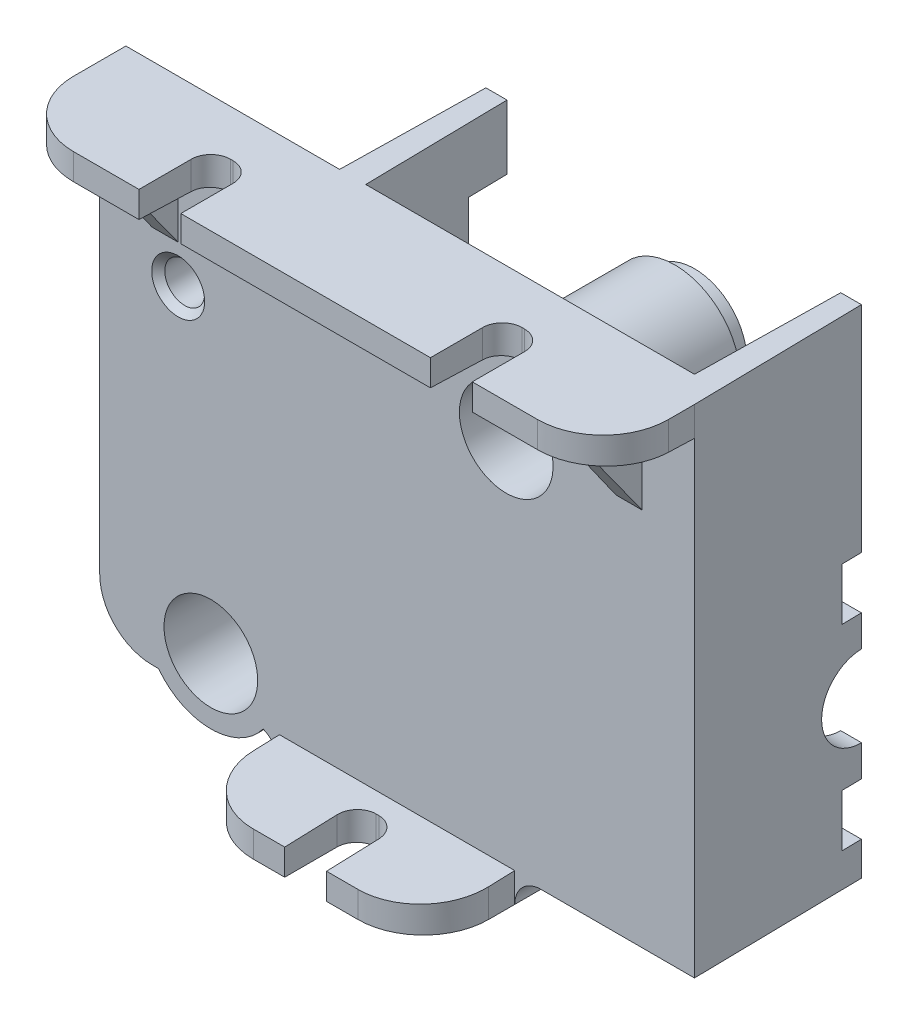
ISO-10303-21;
HEADER;
FILE_DESCRIPTION(('STEP AP214'),'2;1');
FILE_NAME('part.step','',(''),(''),'','','');
FILE_SCHEMA(('AUTOMOTIVE_DESIGN { 1 0 10303 214 1 1 1 1 }'));
ENDSEC;
DATA;
#1=APPLICATION_CONTEXT('core data for automotive mechanical design processes');
#2=APPLICATION_PROTOCOL_DEFINITION('international standard','automotive_design',2000,#1);
#3=PRODUCT_CONTEXT('',#1,'mechanical');
#4=PRODUCT('Part','Part','',(#3));
#5=PRODUCT_RELATED_PRODUCT_CATEGORY('part','',(#4));
#6=PRODUCT_DEFINITION_FORMATION('','',#4);
#7=PRODUCT_DEFINITION_CONTEXT('part definition',#1,'design');
#8=PRODUCT_DEFINITION('design','',#6,#7);
#9=PRODUCT_DEFINITION_SHAPE('','',#8);
#10=(LENGTH_UNIT() NAMED_UNIT(*) SI_UNIT(.MILLI.,.METRE.));
#11=(NAMED_UNIT(*) PLANE_ANGLE_UNIT() SI_UNIT($,.RADIAN.));
#12=(NAMED_UNIT(*) SI_UNIT($,.STERADIAN.) SOLID_ANGLE_UNIT());
#13=UNCERTAINTY_MEASURE_WITH_UNIT(LENGTH_MEASURE(1.E-05),#10,'distance_accuracy_value','');
#14=(GEOMETRIC_REPRESENTATION_CONTEXT(3) GLOBAL_UNCERTAINTY_ASSIGNED_CONTEXT((#13)) GLOBAL_UNIT_ASSIGNED_CONTEXT((#10,
#11,#12)) REPRESENTATION_CONTEXT('',''));
#15=CARTESIAN_POINT('',(0.,0.,0.));
#16=DIRECTION('',(0.,0.,1.));
#17=DIRECTION('',(1.,0.,0.));
#18=AXIS2_PLACEMENT_3D('',#15,#16,#17);
#19=CARTESIAN_POINT('',(25.281177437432,-13.0648359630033,-26.13));
#20=DIRECTION('',(0.,1.,0.));
#21=DIRECTION('',(0.,0.,1.));
#22=AXIS2_PLACEMENT_3D('',#19,#20,#21);
#23=PLANE('',#22);
#24=DIRECTION('',(-0.017452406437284,0.,-0.999847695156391));
#25=VECTOR('',#24,1.);
#26=CARTESIAN_POINT('',(70.5387875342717,-13.0648359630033,-26.919974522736));
#27=LINE('',#26,#25);
#28=CARTESIAN_POINT('',(71.008677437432,-13.0648359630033,2.82430329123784E-13));
#29=VERTEX_POINT('',#28);
#30=CARTESIAN_POINT('',(70.7806270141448,-13.0648359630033,-13.0649999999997));
#31=VERTEX_POINT('',#30);
#32=EDGE_CURVE('E2426',#29,#31,#27,.T.);
#33=ORIENTED_EDGE('',*,*,#32,.F.);
#34=DIRECTION('',(-1.,0.,0.));
#35=VECTOR('',#34,1.);
#36=CARTESIAN_POINT('',(25.281177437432,-13.0648359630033,2.74802966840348E-13));
#37=LINE('',#36,#35);
#38=CARTESIAN_POINT('',(59.199927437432,-13.0648359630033,2.78725610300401E-13));
#39=VERTEX_POINT('',#38);
#40=EDGE_CURVE('E862',#29,#39,#37,.T.);
#41=ORIENTED_EDGE('',*,*,#40,.T.);
#42=DIRECTION('',(0.,0.,1.));
#43=VECTOR('',#42,1.);
#44=CARTESIAN_POINT('',(59.199927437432,-13.0648359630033,-2.00999999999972));
#45=LINE('',#44,#43);
#46=CARTESIAN_POINT('',(59.199927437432,-13.0648359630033,-2.00999999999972));
#47=VERTEX_POINT('',#46);
#48=EDGE_CURVE('E450',#39,#47,#45,.F.);
#49=ORIENTED_EDGE('',*,*,#48,.T.);
#50=DIRECTION('',(-1.,0.,0.));
#51=VECTOR('',#50,1.);
#52=CARTESIAN_POINT('',(68.998677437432,-13.0648359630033,-2.00999999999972));
#53=LINE('',#52,#51);
#54=CARTESIAN_POINT('',(68.998677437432,-13.0648359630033,-2.00999999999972));
#55=VERTEX_POINT('',#54);
#56=EDGE_CURVE('E369',#55,#47,#53,.T.);
#57=ORIENTED_EDGE('',*,*,#56,.F.);
#58=DIRECTION('',(0.0174524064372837,0.,-0.999847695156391));
#59=VECTOR('',#58,1.);
#60=CARTESIAN_POINT('',(68.998677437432,-13.0648359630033,-2.00999999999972));
#61=LINE('',#60,#59);
#62=CARTESIAN_POINT('',(69.1916431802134,-13.0648359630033,-13.0649999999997));
#63=VERTEX_POINT('',#62);
#64=EDGE_CURVE('E343',#63,#55,#61,.F.);
#65=ORIENTED_EDGE('',*,*,#64,.F.);
#66=DIRECTION('',(-1.,0.,0.));
#67=VECTOR('',#66,1.);
#68=CARTESIAN_POINT('',(25.281177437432,-13.0648359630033,-13.0649999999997));
#69=LINE('',#68,#67);
#70=EDGE_CURVE('E779',#31,#63,#69,.T.);
#71=ORIENTED_EDGE('',*,*,#70,.F.);
#72=EDGE_LOOP('',(#33,#41,#49,#57,#65,#71));
#73=FACE_BOUND('',#72,.T.);
#74=ADVANCED_FACE('F16',(#73),#23,.F.);
#75=CARTESIAN_POINT('',(71.008677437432,-13.0648359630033,-26.13));
#76=DIRECTION('',(-1.,0.,0.));
#77=DIRECTION('',(0.,0.,-1.));
#78=AXIS2_PLACEMENT_3D('',#75,#76,#77);
#79=PLANE('',#78);
#80=DIRECTION('',(0.,-1.,0.));
#81=VECTOR('',#80,1.);
#82=CARTESIAN_POINT('',(71.008677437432,-13.0648359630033,-5.57887069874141E-13));
#83=LINE('',#82,#81);
#84=CARTESIAN_POINT('',(71.008677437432,25.1251640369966,-1.63879326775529E-13));
#85=VERTEX_POINT('',#84);
#86=CARTESIAN_POINT('',(71.008677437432,22.8694964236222,-5.57887069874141E-13));
#87=VERTEX_POINT('',#86);
#88=EDGE_CURVE('E691',#85,#87,#83,.T.);
#89=ORIENTED_EDGE('',*,*,#88,.F.);
#90=DIRECTION('',(0.,0.,1.));
#91=VECTOR('',#90,1.);
#92=CARTESIAN_POINT('',(71.008677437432,25.1251640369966,-26.13));
#93=LINE('',#92,#91);
#94=CARTESIAN_POINT('',(71.008677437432,25.1251640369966,2.01000000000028));
#95=VERTEX_POINT('',#94);
#96=EDGE_CURVE('E869',#85,#95,#93,.T.);
#97=ORIENTED_EDGE('',*,*,#96,.T.);
#98=DIRECTION('',(0.,1.,0.));
#99=VECTOR('',#98,1.);
#100=CARTESIAN_POINT('',(71.008677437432,23.1151640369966,2.01000000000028));
#101=LINE('',#100,#99);
#102=CARTESIAN_POINT('',(71.008677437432,22.9396871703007,2.01000000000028));
#103=VERTEX_POINT('',#102);
#104=EDGE_CURVE('E560',#95,#103,#101,.F.);
#105=ORIENTED_EDGE('',*,*,#104,.T.);
#106=DIRECTION('',(0.,-0.0348994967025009,-0.999390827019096));
#107=VECTOR('',#106,1.);
#108=CARTESIAN_POINT('',(71.008677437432,23.1151640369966,7.03500000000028));
#109=LINE('',#108,#107);
#110=EDGE_CURVE('E580',#103,#87,#109,.T.);
#111=ORIENTED_EDGE('',*,*,#110,.T.);
#112=EDGE_LOOP('',(#89,#97,#105,#111));
#113=FACE_BOUND('',#112,.T.);
#114=ADVANCED_FACE('F2673',(#113),#79,.F.);
#115=CARTESIAN_POINT('',(25.281177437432,25.1251640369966,-26.13));
#116=DIRECTION('',(0.,-1.,0.));
#117=DIRECTION('',(0.,0.,-1.));
#118=AXIS2_PLACEMENT_3D('',#115,#116,#117);
#119=PLANE('',#118);
#120=DIRECTION('',(0.017452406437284,0.,0.999847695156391));
#121=VECTOR('',#120,1.);
#122=CARTESIAN_POINT('',(70.5387875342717,25.1251640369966,-26.919974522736));
#123=LINE('',#122,#121);
#124=CARTESIAN_POINT('',(70.7806270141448,25.1251640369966,-13.0649999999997));
#125=VERTEX_POINT('',#124);
#126=EDGE_CURVE('E2521',#125,#85,#123,.T.);
#127=ORIENTED_EDGE('',*,*,#126,.F.);
#128=DIRECTION('',(1.,0.,0.));
#129=VECTOR('',#128,1.);
#130=CARTESIAN_POINT('',(25.281177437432,25.1251640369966,-13.0649999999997));
#131=LINE('',#130,#129);
#132=CARTESIAN_POINT('',(69.1916431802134,25.1251640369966,-13.0649999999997));
#133=VERTEX_POINT('',#132);
#134=EDGE_CURVE('E814',#133,#125,#131,.T.);
#135=ORIENTED_EDGE('',*,*,#134,.F.);
#136=DIRECTION('',(0.0174524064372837,0.,-0.999847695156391));
#137=VECTOR('',#136,1.);
#138=CARTESIAN_POINT('',(69.4062496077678,25.1251640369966,-25.3597940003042));
#139=LINE('',#138,#137);
#140=CARTESIAN_POINT('',(68.998677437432,25.1251640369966,-2.00999999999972));
#141=VERTEX_POINT('',#140);
#142=EDGE_CURVE('E379',#133,#141,#139,.F.);
#143=ORIENTED_EDGE('',*,*,#142,.T.);
#144=DIRECTION('',(-1.,0.,0.));
#145=VECTOR('',#144,1.);
#146=CARTESIAN_POINT('',(25.281177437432,25.1251640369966,-2.00999999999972));
#147=LINE('',#146,#145);
#148=CARTESIAN_POINT('',(43.722927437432,25.1251640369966,-2.00999999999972));
#149=VERTEX_POINT('',#148);
#150=EDGE_CURVE('E380',#141,#149,#147,.T.);
#151=ORIENTED_EDGE('',*,*,#150,.T.);
#152=DIRECTION('',(0.0174524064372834,0.,0.999847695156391));
#153=VECTOR('',#152,1.);
#154=CARTESIAN_POINT('',(43.2964223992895,25.1251640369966,-26.4444572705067));
#155=LINE('',#154,#153);
#156=CARTESIAN_POINT('',(43.5299616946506,25.1251640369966,-13.0649999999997));
#157=VERTEX_POINT('',#156);
#158=EDGE_CURVE('E375',#149,#157,#155,.F.);
#159=ORIENTED_EDGE('',*,*,#158,.T.);
#160=CARTESIAN_POINT('',(41.9058931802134,25.1251640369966,-13.0649999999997));
#161=VERTEX_POINT('',#160);
#162=EDGE_CURVE('E382',#161,#157,#131,.T.);
#163=ORIENTED_EDGE('',*,*,#162,.F.);
#164=DIRECTION('',(0.0174524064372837,0.,-0.999847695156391));
#165=VECTOR('',#164,1.);
#166=CARTESIAN_POINT('',(42.1288104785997,25.1251640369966,-25.8359234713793));
#167=LINE('',#166,#165);
#168=CARTESIAN_POINT('',(41.712927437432,25.1251640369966,-2.00999999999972));
#169=VERTEX_POINT('',#168);
#170=EDGE_CURVE('E747',#161,#169,#167,.F.);
#171=ORIENTED_EDGE('',*,*,#170,.T.);
#172=DIRECTION('',(-1.,0.,0.));
#173=VECTOR('',#172,1.);
#174=CARTESIAN_POINT('',(25.281177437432,25.1251640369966,-2.00999999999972));
#175=LINE('',#174,#173);
#176=CARTESIAN_POINT('',(25.281177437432,25.1251640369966,-2.00999999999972));
#177=VERTEX_POINT('',#176);
#178=EDGE_CURVE('E755',#169,#177,#175,.T.);
#179=ORIENTED_EDGE('',*,*,#178,.T.);
#180=DIRECTION('',(0.,0.,1.));
#181=VECTOR('',#180,1.);
#182=CARTESIAN_POINT('',(25.281177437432,25.1251640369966,-26.13));
#183=LINE('',#182,#181);
#184=CARTESIAN_POINT('',(25.281177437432,25.1251640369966,2.01000000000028));
#185=VERTEX_POINT('',#184);
#186=EDGE_CURVE('E873',#177,#185,#183,.T.);
#187=ORIENTED_EDGE('',*,*,#186,.T.);
#188=CARTESIAN_POINT('',(30.306177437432,25.1251640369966,2.01000000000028));
#189=DIRECTION('',(0.,-1.,0.));
#190=DIRECTION('',(0.,0.,-1.));
#191=AXIS2_PLACEMENT_3D('',#188,#189,#190);
#192=CIRCLE('',#191,5.025);
#193=CARTESIAN_POINT('',(30.306177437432,25.1251640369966,7.03500000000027));
#194=VERTEX_POINT('',#193);
#195=EDGE_CURVE('E525',#185,#194,#192,.F.);
#196=ORIENTED_EDGE('',*,*,#195,.T.);
#197=DIRECTION('',(1.,0.,0.));
#198=VECTOR('',#197,1.);
#199=CARTESIAN_POINT('',(25.281177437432,25.1251640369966,7.03500000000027));
#200=LINE('',#199,#198);
#201=CARTESIAN_POINT('',(35.331177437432,25.1251640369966,7.03500000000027));
#202=VERTEX_POINT('',#201);
#203=EDGE_CURVE('E586',#194,#202,#200,.T.);
#204=ORIENTED_EDGE('',*,*,#203,.T.);
#205=DIRECTION('',(0.,0.,-1.));
#206=VECTOR('',#205,1.);
#207=CARTESIAN_POINT('',(35.331177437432,25.1251640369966,8.61871782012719));
#208=LINE('',#207,#206);
#209=CARTESIAN_POINT('',(35.331177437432,25.1251640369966,3.01500000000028));
#210=VERTEX_POINT('',#209);
#211=EDGE_CURVE('E610',#202,#210,#208,.T.);
#212=ORIENTED_EDGE('',*,*,#211,.T.);
#213=CARTESIAN_POINT('',(36.838677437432,25.1251640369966,3.01500000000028));
#214=DIRECTION('',(0.,-1.,0.));
#215=DIRECTION('',(0.,0.,1.));
#216=AXIS2_PLACEMENT_3D('',#213,#214,#215);
#217=CIRCLE('',#216,1.5075);
#218=CARTESIAN_POINT('',(36.838677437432,25.1251640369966,1.50750000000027));
#219=VERTEX_POINT('',#218);
#220=EDGE_CURVE('E1018',#210,#219,#217,.T.);
#221=ORIENTED_EDGE('',*,*,#220,.T.);
#222=DIRECTION('',(1.,0.,0.));
#223=VECTOR('',#222,1.);
#224=CARTESIAN_POINT('',(36.838677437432,25.1251640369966,1.50750000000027));
#225=LINE('',#224,#223);
#226=CARTESIAN_POINT('',(37.039677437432,25.1251640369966,1.50750000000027));
#227=VERTEX_POINT('',#226);
#228=EDGE_CURVE('E1022',#219,#227,#225,.T.);
#229=ORIENTED_EDGE('',*,*,#228,.T.);
#230=CARTESIAN_POINT('',(37.039677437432,25.1251640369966,3.01500000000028));
#231=DIRECTION('',(0.,-1.,0.));
#232=DIRECTION('',(0.,0.,1.));
#233=AXIS2_PLACEMENT_3D('',#230,#231,#232);
#234=CIRCLE('',#233,1.5075);
#235=CARTESIAN_POINT('',(38.547177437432,25.1251640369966,3.01500000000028));
#236=VERTEX_POINT('',#235);
#237=EDGE_CURVE('E1026',#227,#236,#234,.T.);
#238=ORIENTED_EDGE('',*,*,#237,.T.);
#239=DIRECTION('',(0.,0.,1.));
#240=VECTOR('',#239,1.);
#241=CARTESIAN_POINT('',(38.547177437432,25.1251640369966,8.61871782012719));
#242=LINE('',#241,#240);
#243=CARTESIAN_POINT('',(38.547177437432,25.1251640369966,7.03500000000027));
#244=VERTEX_POINT('',#243);
#245=EDGE_CURVE('E531',#236,#244,#242,.T.);
#246=ORIENTED_EDGE('',*,*,#245,.T.);
#247=CARTESIAN_POINT('',(57.742677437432,25.1251640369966,7.03500000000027));
#248=VERTEX_POINT('',#247);
#249=EDGE_CURVE('E1052',#244,#248,#200,.T.);
#250=ORIENTED_EDGE('',*,*,#249,.T.);
#251=DIRECTION('',(0.,0.,-1.));
#252=VECTOR('',#251,1.);
#253=CARTESIAN_POINT('',(57.742677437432,25.1251640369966,8.6187178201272));
#254=LINE('',#253,#252);
#255=CARTESIAN_POINT('',(57.742677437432,25.1251640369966,3.01500000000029));
#256=VERTEX_POINT('',#255);
#257=EDGE_CURVE('E551',#248,#256,#254,.T.);
#258=ORIENTED_EDGE('',*,*,#257,.T.);
#259=CARTESIAN_POINT('',(59.250177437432,25.1251640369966,3.01500000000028));
#260=DIRECTION('',(0.,-1.,0.));
#261=DIRECTION('',(0.,0.,-1.));
#262=AXIS2_PLACEMENT_3D('',#259,#260,#261);
#263=CIRCLE('',#262,1.5075);
#264=CARTESIAN_POINT('',(59.250177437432,25.1251640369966,1.50750000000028));
#265=VERTEX_POINT('',#264);
#266=EDGE_CURVE('E617',#256,#265,#263,.T.);
#267=ORIENTED_EDGE('',*,*,#266,.T.);
#268=DIRECTION('',(1.,0.,0.));
#269=VECTOR('',#268,1.);
#270=CARTESIAN_POINT('',(59.451177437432,25.1251640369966,1.50750000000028));
#271=LINE('',#270,#269);
#272=CARTESIAN_POINT('',(59.451177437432,25.1251640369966,1.50750000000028));
#273=VERTEX_POINT('',#272);
#274=EDGE_CURVE('E1000',#265,#273,#271,.T.);
#275=ORIENTED_EDGE('',*,*,#274,.T.);
#276=CARTESIAN_POINT('',(59.451177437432,25.1251640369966,3.01500000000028));
#277=DIRECTION('',(0.,-1.,0.));
#278=DIRECTION('',(0.,0.,-1.));
#279=AXIS2_PLACEMENT_3D('',#276,#277,#278);
#280=CIRCLE('',#279,1.5075);
#281=CARTESIAN_POINT('',(60.958677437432,25.1251640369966,3.01500000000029));
#282=VERTEX_POINT('',#281);
#283=EDGE_CURVE('E1004',#273,#282,#280,.T.);
#284=ORIENTED_EDGE('',*,*,#283,.T.);
#285=DIRECTION('',(0.,0.,1.));
#286=VECTOR('',#285,1.);
#287=CARTESIAN_POINT('',(60.958677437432,25.1251640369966,8.6187178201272));
#288=LINE('',#287,#286);
#289=CARTESIAN_POINT('',(60.958677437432,25.1251640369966,7.03500000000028));
#290=VERTEX_POINT('',#289);
#291=EDGE_CURVE('E1008',#282,#290,#288,.T.);
#292=ORIENTED_EDGE('',*,*,#291,.T.);
#293=CARTESIAN_POINT('',(65.983677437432,25.1251640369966,7.03500000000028));
#294=VERTEX_POINT('',#293);
#295=EDGE_CURVE('E1048',#290,#294,#200,.T.);
#296=ORIENTED_EDGE('',*,*,#295,.T.);
#297=CARTESIAN_POINT('',(65.983677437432,25.1251640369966,2.01000000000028));
#298=DIRECTION('',(0.,-1.,0.));
#299=DIRECTION('',(0.,0.,-1.));
#300=AXIS2_PLACEMENT_3D('',#297,#298,#299);
#301=CIRCLE('',#300,5.025);
#302=EDGE_CURVE('E519',#294,#95,#301,.F.);
#303=ORIENTED_EDGE('',*,*,#302,.T.);
#304=ORIENTED_EDGE('',*,*,#96,.F.);
#305=EDGE_LOOP('',(#127,#135,#143,#151,#159,#163,#171,#179,#187,#196,#204,#212,#221,#229,#238,
#246,#250,#258,#267,#275,#284,#292,#296,#303,#304));
#306=FACE_BOUND('',#305,.T.);
#307=ADVANCED_FACE('F2679',(#306),#119,.F.);
#308=CARTESIAN_POINT('',(67.993677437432,-0.92443596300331,-13.0649999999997));
#309=DIRECTION('',(1.,0.,0.));
#310=DIRECTION('',(0.,-1.,0.));
#311=AXIS2_PLACEMENT_3D('',#308,#309,#310);
#312=CYLINDRICAL_SURFACE('',#311,3.1155);
#313=CARTESIAN_POINT('',(70.7806270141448,-0.92443596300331,-13.0649999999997));
#314=DIRECTION('',(0.999847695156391,0.,-0.017452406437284));
#315=DIRECTION('',(0.017452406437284,0.,0.999847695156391));
#316=AXIS2_PLACEMENT_3D('',#313,#314,#315);
#317=ELLIPSE('',#316,3.11597457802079,3.1155);
#318=CARTESIAN_POINT('',(70.7806270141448,-4.03993596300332,-13.0649999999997));
#319=VERTEX_POINT('',#318);
#320=CARTESIAN_POINT('',(70.7806270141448,2.19106403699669,-13.0649999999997));
#321=VERTEX_POINT('',#320);
#322=EDGE_CURVE('E2241',#319,#321,#317,.F.);
#323=ORIENTED_EDGE('',*,*,#322,.F.);
#324=DIRECTION('',(1.,0.,0.));
#325=VECTOR('',#324,1.);
#326=CARTESIAN_POINT('',(67.993677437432,-4.03993596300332,-13.0649999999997));
#327=LINE('',#326,#325);
#328=CARTESIAN_POINT('',(69.1916431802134,-4.03993596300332,-13.0649999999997));
#329=VERTEX_POINT('',#328);
#330=EDGE_CURVE('E726',#329,#319,#327,.T.);
#331=ORIENTED_EDGE('',*,*,#330,.F.);
#332=CARTESIAN_POINT('',(69.1916431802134,-0.92443596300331,-13.0649999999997));
#333=DIRECTION('',(-0.999847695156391,0.,-0.0174524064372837));
#334=DIRECTION('',(0.0174524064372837,0.,-0.999847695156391));
#335=AXIS2_PLACEMENT_3D('',#332,#333,#334);
#336=ELLIPSE('',#335,3.11597457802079,3.1155);
#337=CARTESIAN_POINT('',(69.1916431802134,2.19106403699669,-13.0649999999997));
#338=VERTEX_POINT('',#337);
#339=EDGE_CURVE('E645',#338,#329,#336,.F.);
#340=ORIENTED_EDGE('',*,*,#339,.F.);
#341=DIRECTION('',(1.,0.,0.));
#342=VECTOR('',#341,1.);
#343=CARTESIAN_POINT('',(67.993677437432,2.19106403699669,-13.0649999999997));
#344=LINE('',#343,#342);
#345=EDGE_CURVE('E732',#321,#338,#344,.F.);
#346=ORIENTED_EDGE('',*,*,#345,.F.);
#347=EDGE_LOOP('',(#323,#331,#340,#346));
#348=FACE_BOUND('',#347,.T.);
#349=ADVANCED_FACE('F2838',(#348),#312,.F.);
#350=CARTESIAN_POINT('',(67.993677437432,-6.45193596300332,-11.5574999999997));
#351=DIRECTION('',(0.,1.,0.));
#352=DIRECTION('',(0.,0.,1.));
#353=AXIS2_PLACEMENT_3D('',#350,#351,#352);
#354=PLANE('',#353);
#355=DIRECTION('',(-0.017452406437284,0.,-0.999847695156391));
#356=VECTOR('',#355,1.);
#357=CARTESIAN_POINT('',(70.8060836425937,-6.45193596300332,-11.6065907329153));
#358=LINE('',#357,#356);
#359=CARTESIAN_POINT('',(70.8069405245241,-6.45193596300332,-11.5574999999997));
#360=VERTEX_POINT('',#359);
#361=CARTESIAN_POINT('',(70.7806270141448,-6.45193596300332,-13.0649999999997));
#362=VERTEX_POINT('',#361);
#363=EDGE_CURVE('E34',#360,#362,#358,.T.);
#364=ORIENTED_EDGE('',*,*,#363,.F.);
#365=DIRECTION('',(1.,0.,0.));
#366=VECTOR('',#365,1.);
#367=CARTESIAN_POINT('',(67.993677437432,-6.45193596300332,-11.5574999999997));
#368=LINE('',#367,#366);
#369=CARTESIAN_POINT('',(69.1653296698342,-6.45193596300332,-11.5574999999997));
#370=VERTEX_POINT('',#369);
#371=EDGE_CURVE('E624',#370,#360,#368,.T.);
#372=ORIENTED_EDGE('',*,*,#371,.F.);
#373=DIRECTION('',(0.0174524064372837,0.,-0.999847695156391));
#374=VECTOR('',#373,1.);
#375=CARTESIAN_POINT('',(68.998677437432,-6.45193596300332,-2.00999999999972));
#376=LINE('',#375,#374);
#377=CARTESIAN_POINT('',(69.1916431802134,-6.45193596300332,-13.0649999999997));
#378=VERTEX_POINT('',#377);
#379=EDGE_CURVE('E784',#378,#370,#376,.F.);
#380=ORIENTED_EDGE('',*,*,#379,.F.);
#381=DIRECTION('',(-1.,0.,0.));
#382=VECTOR('',#381,1.);
#383=CARTESIAN_POINT('',(67.993677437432,-6.45193596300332,-13.0649999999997));
#384=LINE('',#383,#382);
#385=EDGE_CURVE('E795',#362,#378,#384,.T.);
#386=ORIENTED_EDGE('',*,*,#385,.F.);
#387=EDGE_LOOP('',(#364,#372,#380,#386));
#388=FACE_BOUND('',#387,.T.);
#389=ADVANCED_FACE('F2846',(#388),#354,.F.);
#390=CARTESIAN_POINT('',(67.993677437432,-10.4719359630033,-11.5574999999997));
#391=DIRECTION('',(0.,-1.,0.));
#392=DIRECTION('',(0.,0.,-1.));
#393=AXIS2_PLACEMENT_3D('',#390,#391,#392);
#394=PLANE('',#393);
#395=DIRECTION('',(0.017452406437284,0.,0.999847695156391));
#396=VECTOR('',#395,1.);
#397=CARTESIAN_POINT('',(70.8060836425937,-10.4719359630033,-11.6065907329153));
#398=LINE('',#397,#396);
#399=CARTESIAN_POINT('',(70.7806270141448,-10.4719359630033,-13.0649999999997));
#400=VERTEX_POINT('',#399);
#401=CARTESIAN_POINT('',(70.8069405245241,-10.4719359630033,-11.5574999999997));
#402=VERTEX_POINT('',#401);
#403=EDGE_CURVE('E2472',#400,#402,#398,.T.);
#404=ORIENTED_EDGE('',*,*,#403,.F.);
#405=DIRECTION('',(1.,0.,0.));
#406=VECTOR('',#405,1.);
#407=CARTESIAN_POINT('',(67.993677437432,-10.4719359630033,-13.0649999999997));
#408=LINE('',#407,#406);
#409=CARTESIAN_POINT('',(69.1916431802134,-10.4719359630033,-13.0649999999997));
#410=VERTEX_POINT('',#409);
#411=EDGE_CURVE('E735',#410,#400,#408,.T.);
#412=ORIENTED_EDGE('',*,*,#411,.F.);
#413=DIRECTION('',(-0.0174524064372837,0.,0.999847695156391));
#414=VECTOR('',#413,1.);
#415=CARTESIAN_POINT('',(68.998677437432,-10.4719359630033,-2.00999999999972));
#416=LINE('',#415,#414);
#417=CARTESIAN_POINT('',(69.1653296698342,-10.4719359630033,-11.5574999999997));
#418=VERTEX_POINT('',#417);
#419=EDGE_CURVE('E780',#418,#410,#416,.F.);
#420=ORIENTED_EDGE('',*,*,#419,.F.);
#421=DIRECTION('',(1.,0.,0.));
#422=VECTOR('',#421,1.);
#423=CARTESIAN_POINT('',(67.993677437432,-10.4719359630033,-11.5574999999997));
#424=LINE('',#423,#422);
#425=EDGE_CURVE('E985',#418,#402,#424,.T.);
#426=ORIENTED_EDGE('',*,*,#425,.T.);
#427=EDGE_LOOP('',(#404,#412,#420,#426));
#428=FACE_BOUND('',#427,.T.);
#429=ADVANCED_FACE('F2853',(#428),#394,.F.);
#430=CARTESIAN_POINT('',(67.993677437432,4.60306403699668,-11.5574999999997));
#431=DIRECTION('',(0.,-1.,0.));
#432=DIRECTION('',(0.,0.,-1.));
#433=AXIS2_PLACEMENT_3D('',#430,#431,#432);
#434=PLANE('',#433);
#435=DIRECTION('',(0.017452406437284,0.,0.999847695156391));
#436=VECTOR('',#435,1.);
#437=CARTESIAN_POINT('',(70.8060836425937,4.60306403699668,-11.6065907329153));
#438=LINE('',#437,#436);
#439=CARTESIAN_POINT('',(70.7806270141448,4.60306403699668,-13.0649999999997));
#440=VERTEX_POINT('',#439);
#441=CARTESIAN_POINT('',(70.8069405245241,4.60306403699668,-11.5574999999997));
#442=VERTEX_POINT('',#441);
#443=EDGE_CURVE('E2483',#440,#442,#438,.T.);
#444=ORIENTED_EDGE('',*,*,#443,.F.);
#445=DIRECTION('',(1.,0.,0.));
#446=VECTOR('',#445,1.);
#447=CARTESIAN_POINT('',(67.993677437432,4.60306403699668,-13.0649999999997));
#448=LINE('',#447,#446);
#449=CARTESIAN_POINT('',(69.1916431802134,4.60306403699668,-13.0649999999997));
#450=VERTEX_POINT('',#449);
#451=EDGE_CURVE('E801',#450,#440,#448,.T.);
#452=ORIENTED_EDGE('',*,*,#451,.F.);
#453=DIRECTION('',(-0.0174524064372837,0.,0.999847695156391));
#454=VECTOR('',#453,1.);
#455=CARTESIAN_POINT('',(68.998677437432,4.60306403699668,-2.00999999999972));
#456=LINE('',#455,#454);
#457=CARTESIAN_POINT('',(69.1653296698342,4.60306403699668,-11.5574999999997));
#458=VERTEX_POINT('',#457);
#459=EDGE_CURVE('E520',#458,#450,#456,.F.);
#460=ORIENTED_EDGE('',*,*,#459,.F.);
#461=DIRECTION('',(1.,0.,0.));
#462=VECTOR('',#461,1.);
#463=CARTESIAN_POINT('',(67.993677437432,4.60306403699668,-11.5574999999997));
#464=LINE('',#463,#462);
#465=EDGE_CURVE('E973',#458,#442,#464,.T.);
#466=ORIENTED_EDGE('',*,*,#465,.T.);
#467=EDGE_LOOP('',(#444,#452,#460,#466));
#468=FACE_BOUND('',#467,.T.);
#469=ADVANCED_FACE('F2891',(#468),#434,.F.);
#470=CARTESIAN_POINT('',(67.993677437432,8.62306403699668,-11.5574999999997));
#471=DIRECTION('',(0.,1.,0.));
#472=DIRECTION('',(0.,0.,1.));
#473=AXIS2_PLACEMENT_3D('',#470,#471,#472);
#474=PLANE('',#473);
#475=DIRECTION('',(-0.017452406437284,0.,-0.999847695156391));
#476=VECTOR('',#475,1.);
#477=CARTESIAN_POINT('',(70.8060836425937,8.62306403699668,-11.6065907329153));
#478=LINE('',#477,#476);
#479=CARTESIAN_POINT('',(70.8069405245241,8.62306403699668,-11.5574999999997));
#480=VERTEX_POINT('',#479);
#481=CARTESIAN_POINT('',(70.7806270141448,8.62306403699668,-13.0649999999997));
#482=VERTEX_POINT('',#481);
#483=EDGE_CURVE('E969',#480,#482,#478,.T.);
#484=ORIENTED_EDGE('',*,*,#483,.F.);
#485=DIRECTION('',(1.,0.,0.));
#486=VECTOR('',#485,1.);
#487=CARTESIAN_POINT('',(67.993677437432,8.62306403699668,-11.5574999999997));
#488=LINE('',#487,#486);
#489=CARTESIAN_POINT('',(69.1653296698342,8.62306403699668,-11.5574999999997));
#490=VERTEX_POINT('',#489);
#491=EDGE_CURVE('E966',#490,#480,#488,.T.);
#492=ORIENTED_EDGE('',*,*,#491,.F.);
#493=DIRECTION('',(0.0174524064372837,0.,-0.999847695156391));
#494=VECTOR('',#493,1.);
#495=CARTESIAN_POINT('',(68.998677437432,8.62306403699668,-2.00999999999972));
#496=LINE('',#495,#494);
#497=CARTESIAN_POINT('',(69.1916431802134,8.62306403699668,-13.0649999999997));
#498=VERTEX_POINT('',#497);
#499=EDGE_CURVE('E790',#498,#490,#496,.F.);
#500=ORIENTED_EDGE('',*,*,#499,.F.);
#501=DIRECTION('',(-1.,0.,0.));
#502=VECTOR('',#501,1.);
#503=CARTESIAN_POINT('',(67.993677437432,8.62306403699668,-13.0649999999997));
#504=LINE('',#503,#502);
#505=EDGE_CURVE('E427',#482,#498,#504,.T.);
#506=ORIENTED_EDGE('',*,*,#505,.F.);
#507=EDGE_LOOP('',(#484,#492,#500,#506));
#508=FACE_BOUND('',#507,.T.);
#509=ADVANCED_FACE('F964',(#508),#474,.F.);
#510=CARTESIAN_POINT('',(67.993677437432,-6.45193596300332,-11.5574999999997));
#511=DIRECTION('',(0.,0.,1.));
#512=DIRECTION('',(-1.,0.,0.));
#513=AXIS2_PLACEMENT_3D('',#510,#511,#512);
#514=PLANE('',#513);
#515=DIRECTION('',(0.,1.,0.));
#516=VECTOR('',#515,1.);
#517=CARTESIAN_POINT('',(70.8069405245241,-6.45193596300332,-11.5574999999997));
#518=LINE('',#517,#516);
#519=EDGE_CURVE('E2493',#402,#360,#518,.T.);
#520=ORIENTED_EDGE('',*,*,#519,.F.);
#521=ORIENTED_EDGE('',*,*,#425,.F.);
#522=DIRECTION('',(0.,1.,0.));
#523=VECTOR('',#522,1.);
#524=CARTESIAN_POINT('',(69.1653296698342,27.1351640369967,-11.5574999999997));
#525=LINE('',#524,#523);
#526=EDGE_CURVE('E786',#370,#418,#525,.F.);
#527=ORIENTED_EDGE('',*,*,#526,.F.);
#528=ORIENTED_EDGE('',*,*,#371,.T.);
#529=EDGE_LOOP('',(#520,#521,#527,#528));
#530=FACE_BOUND('',#529,.T.);
#531=ADVANCED_FACE('F2848',(#530),#514,.F.);
#532=CARTESIAN_POINT('',(67.993677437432,4.60306403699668,-11.5574999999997));
#533=DIRECTION('',(0.,0.,1.));
#534=DIRECTION('',(-1.,0.,0.));
#535=AXIS2_PLACEMENT_3D('',#532,#533,#534);
#536=PLANE('',#535);
#537=DIRECTION('',(0.,1.,0.));
#538=VECTOR('',#537,1.);
#539=CARTESIAN_POINT('',(70.8069405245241,4.60306403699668,-11.5574999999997));
#540=LINE('',#539,#538);
#541=EDGE_CURVE('E2449',#442,#480,#540,.T.);
#542=ORIENTED_EDGE('',*,*,#541,.F.);
#543=ORIENTED_EDGE('',*,*,#465,.F.);
#544=DIRECTION('',(0.,1.,0.));
#545=VECTOR('',#544,1.);
#546=CARTESIAN_POINT('',(69.1653296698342,27.1351640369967,-11.5574999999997));
#547=LINE('',#546,#545);
#548=EDGE_CURVE('E805',#490,#458,#547,.F.);
#549=ORIENTED_EDGE('',*,*,#548,.F.);
#550=ORIENTED_EDGE('',*,*,#491,.T.);
#551=EDGE_LOOP('',(#542,#543,#549,#550));
#552=FACE_BOUND('',#551,.T.);
#553=ADVANCED_FACE('F2886',(#552),#536,.F.);
#554=CARTESIAN_POINT('',(22.5951649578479,26.4835161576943,-13.0649999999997));
#555=DIRECTION('',(0.,0.,-1.));
#556=DIRECTION('',(1.,0.,0.));
#557=AXIS2_PLACEMENT_3D('',#554,#555,#556);
#558=PLANE('',#557);
#559=ORIENTED_EDGE('',*,*,#134,.T.);
#560=DIRECTION('',(0.,-1.,0.));
#561=VECTOR('',#560,1.);
#562=CARTESIAN_POINT('',(70.7806270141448,26.4835161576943,-13.0649999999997));
#563=LINE('',#562,#561);
#564=EDGE_CURVE('E956',#125,#482,#563,.T.);
#565=ORIENTED_EDGE('',*,*,#564,.T.);
#566=ORIENTED_EDGE('',*,*,#505,.T.);
#567=DIRECTION('',(0.,-1.,0.));
#568=VECTOR('',#567,1.);
#569=CARTESIAN_POINT('',(69.1916431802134,27.1351640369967,-13.0649999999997));
#570=LINE('',#569,#568);
#571=EDGE_CURVE('E811',#498,#133,#570,.F.);
#572=ORIENTED_EDGE('',*,*,#571,.T.);
#573=EDGE_LOOP('',(#559,#565,#566,#572));
#574=FACE_BOUND('',#573,.T.);
#575=ADVANCED_FACE('F952',(#574),#558,.T.);
#576=ORIENTED_EDGE('',*,*,#451,.T.);
#577=DIRECTION('',(0.,-1.,0.));
#578=VECTOR('',#577,1.);
#579=CARTESIAN_POINT('',(70.7806270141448,26.4835161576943,-13.0649999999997));
#580=LINE('',#579,#578);
#581=EDGE_CURVE('E2250',#440,#321,#580,.T.);
#582=ORIENTED_EDGE('',*,*,#581,.T.);
#583=ORIENTED_EDGE('',*,*,#345,.T.);
#584=DIRECTION('',(0.,-1.,0.));
#585=VECTOR('',#584,1.);
#586=CARTESIAN_POINT('',(69.1916431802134,27.1351640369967,-13.0649999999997));
#587=LINE('',#586,#585);
#588=EDGE_CURVE('E736',#338,#450,#587,.F.);
#589=ORIENTED_EDGE('',*,*,#588,.T.);
#590=EDGE_LOOP('',(#576,#582,#583,#589));
#591=FACE_BOUND('',#590,.T.);
#592=ADVANCED_FACE('F2857',(#591),#558,.T.);
#593=ORIENTED_EDGE('',*,*,#411,.T.);
#594=DIRECTION('',(0.,-1.,0.));
#595=VECTOR('',#594,1.);
#596=CARTESIAN_POINT('',(70.7806270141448,26.4835161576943,-13.0649999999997));
#597=LINE('',#596,#595);
#598=EDGE_CURVE('E2461',#400,#31,#597,.T.);
#599=ORIENTED_EDGE('',*,*,#598,.T.);
#600=ORIENTED_EDGE('',*,*,#70,.T.);
#601=DIRECTION('',(0.,-1.,0.));
#602=VECTOR('',#601,1.);
#603=CARTESIAN_POINT('',(69.1916431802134,27.1351640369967,-13.0649999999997));
#604=LINE('',#603,#602);
#605=EDGE_CURVE('E776',#63,#410,#604,.F.);
#606=ORIENTED_EDGE('',*,*,#605,.T.);
#607=EDGE_LOOP('',(#593,#599,#600,#606));
#608=FACE_BOUND('',#607,.T.);
#609=ADVANCED_FACE('F2855',(#608),#558,.T.);
#610=ORIENTED_EDGE('',*,*,#330,.T.);
#611=DIRECTION('',(0.,-1.,0.));
#612=VECTOR('',#611,1.);
#613=CARTESIAN_POINT('',(70.7806270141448,26.4835161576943,-13.0649999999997));
#614=LINE('',#613,#612);
#615=EDGE_CURVE('E11',#319,#362,#614,.T.);
#616=ORIENTED_EDGE('',*,*,#615,.T.);
#617=ORIENTED_EDGE('',*,*,#385,.T.);
#618=DIRECTION('',(0.,-1.,0.));
#619=VECTOR('',#618,1.);
#620=CARTESIAN_POINT('',(69.1916431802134,27.1351640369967,-13.0649999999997));
#621=LINE('',#620,#619);
#622=EDGE_CURVE('E731',#378,#329,#621,.F.);
#623=ORIENTED_EDGE('',*,*,#622,.T.);
#624=EDGE_LOOP('',(#610,#616,#617,#623));
#625=FACE_BOUND('',#624,.T.);
#626=ADVANCED_FACE('F2684',(#625),#558,.T.);
#627=DIRECTION('',(1.,0.,0.));
#628=VECTOR('',#627,1.);
#629=CARTESIAN_POINT('',(57.189927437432,-13.0648359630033,-2.00999999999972));
#630=LINE('',#629,#628);
#631=CARTESIAN_POINT('',(41.712927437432,-13.0648359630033,-2.00999999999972));
#632=VERTEX_POINT('',#631);
#633=CARTESIAN_POINT('',(43.722927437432,-13.0648359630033,-2.00999999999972));
#634=VERTEX_POINT('',#633);
#635=EDGE_CURVE('E715',#632,#634,#630,.T.);
#636=ORIENTED_EDGE('',*,*,#635,.F.);
#637=DIRECTION('',(0.0174524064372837,0.,-0.999847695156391));
#638=VECTOR('',#637,1.);
#639=CARTESIAN_POINT('',(41.712927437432,-13.0648359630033,-2.00999999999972));
#640=LINE('',#639,#638);
#641=CARTESIAN_POINT('',(41.9058931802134,-13.0648359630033,-13.0649999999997));
#642=VERTEX_POINT('',#641);
#643=EDGE_CURVE('E757',#642,#632,#640,.F.);
#644=ORIENTED_EDGE('',*,*,#643,.F.);
#645=CARTESIAN_POINT('',(43.5299616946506,-13.0648359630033,-13.0649999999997));
#646=VERTEX_POINT('',#645);
#647=EDGE_CURVE('E362',#646,#642,#69,.T.);
#648=ORIENTED_EDGE('',*,*,#647,.F.);
#649=DIRECTION('',(0.0174524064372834,0.,0.999847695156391));
#650=VECTOR('',#649,1.);
#651=CARTESIAN_POINT('',(43.722927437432,-13.0648359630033,-2.00999999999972));
#652=LINE('',#651,#650);
#653=EDGE_CURVE('E364',#634,#646,#652,.F.);
#654=ORIENTED_EDGE('',*,*,#653,.F.);
#655=EDGE_LOOP('',(#636,#644,#648,#654));
#656=FACE_BOUND('',#655,.T.);
#657=ADVANCED_FACE('F2675',(#656),#23,.F.);
#658=CARTESIAN_POINT('',(71.008677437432,25.1251640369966,2.80469007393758E-13));
#659=DIRECTION('',(0.,0.,-1.));
#660=DIRECTION('',(1.,0.,0.));
#661=AXIS2_PLACEMENT_3D('',#658,#659,#660);
#662=PLANE('',#661);
#663=CARTESIAN_POINT('',(33.823677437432,-10.0498359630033,2.75456740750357E-13));
#664=DIRECTION('',(0.,0.,-1.));
#665=DIRECTION('',(-1.,0.,0.));
#666=AXIS2_PLACEMENT_3D('',#663,#664,#665);
#667=CIRCLE('',#666,3.60204910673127);
#668=CARTESIAN_POINT('',(30.2216283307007,-10.0498359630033,2.75015631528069E-13));
#669=VERTEX_POINT('',#668);
#670=EDGE_CURVE('E20',#669,#669,#667,.F.);
#671=ORIENTED_EDGE('',*,*,#670,.F.);
#672=EDGE_LOOP('',(#671));
#673=FACE_BOUND('',#672,.T.);
#674=CARTESIAN_POINT('',(56.5361979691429,15.5776640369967,2.7894353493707E-13));
#675=DIRECTION('',(0.,0.,-1.));
#676=DIRECTION('',(-1.,0.,0.));
#677=AXIS2_PLACEMENT_3D('',#674,#675,#676);
#678=CIRCLE('',#677,3.60204910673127);
#679=CARTESIAN_POINT('',(52.9341488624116,15.5776640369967,2.78502425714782E-13));
#680=VERTEX_POINT('',#679);
#681=EDGE_CURVE('E383',#680,#680,#678,.F.);
#682=ORIENTED_EDGE('',*,*,#681,.F.);
#683=EDGE_LOOP('',(#682));
#684=FACE_BOUND('',#683,.T.);
#685=CARTESIAN_POINT('',(31.311177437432,13.1455640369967,2.75674665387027E-13));
#686=DIRECTION('',(0.,0.,-1.));
#687=DIRECTION('',(1.,0.,0.));
#688=AXIS2_PLACEMENT_3D('',#685,#686,#687);
#689=CIRCLE('',#688,2.035125);
#690=CARTESIAN_POINT('',(33.346302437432,13.1455640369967,2.75923888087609E-13));
#691=VERTEX_POINT('',#690);
#692=EDGE_CURVE('E924',#691,#691,#689,.T.);
#693=ORIENTED_EDGE('',*,*,#692,.T.);
#694=EDGE_LOOP('',(#693));
#695=FACE_BOUND('',#694,.T.);
#696=DIRECTION('',(0.,1.,0.));
#697=VECTOR('',#696,1.);
#698=CARTESIAN_POINT('',(64.978677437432,25.1251640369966,2.79730569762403E-13));
#699=LINE('',#698,#697);
#700=CARTESIAN_POINT('',(64.978677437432,22.8694964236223,2.79730569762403E-13));
#701=VERTEX_POINT('',#700);
#702=CARTESIAN_POINT('',(64.978677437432,16.0801640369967,2.79730569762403E-13));
#703=VERTEX_POINT('',#702);
#704=EDGE_CURVE('E488',#701,#703,#699,.F.);
#705=ORIENTED_EDGE('',*,*,#704,.F.);
#706=DIRECTION('',(-1.,0.,0.));
#707=VECTOR('',#706,1.);
#708=CARTESIAN_POINT('',(71.008677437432,22.8694964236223,2.80469007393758E-13));
#709=LINE('',#708,#707);
#710=CARTESIAN_POINT('',(31.311177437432,22.8694964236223,2.75607626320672E-13));
#711=VERTEX_POINT('',#710);
#712=EDGE_CURVE('E565',#701,#711,#709,.T.);
#713=ORIENTED_EDGE('',*,*,#712,.T.);
#714=DIRECTION('',(0.,-1.,0.));
#715=VECTOR('',#714,1.);
#716=CARTESIAN_POINT('',(31.311177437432,25.1251640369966,2.75607626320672E-13));
#717=LINE('',#716,#715);
#718=CARTESIAN_POINT('',(31.311177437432,16.0801640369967,2.75607626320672E-13));
#719=VERTEX_POINT('',#718);
#720=EDGE_CURVE('E498',#719,#711,#717,.F.);
#721=ORIENTED_EDGE('',*,*,#720,.F.);
#722=DIRECTION('',(-1.,0.,0.));
#723=VECTOR('',#722,1.);
#724=CARTESIAN_POINT('',(71.008677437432,16.0801640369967,2.80469007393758E-13));
#725=LINE('',#724,#723);
#726=CARTESIAN_POINT('',(29.301177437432,16.0801640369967,2.75361480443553E-13));
#727=VERTEX_POINT('',#726);
#728=EDGE_CURVE('E436',#719,#727,#725,.T.);
#729=ORIENTED_EDGE('',*,*,#728,.T.);
#730=DIRECTION('',(0.,1.,0.));
#731=VECTOR('',#730,1.);
#732=CARTESIAN_POINT('',(29.301177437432,25.1251640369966,2.75361480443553E-13));
#733=LINE('',#732,#731);
#734=CARTESIAN_POINT('',(29.301177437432,22.8694964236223,2.75361480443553E-13));
#735=VERTEX_POINT('',#734);
#736=EDGE_CURVE('E319',#735,#727,#733,.F.);
#737=ORIENTED_EDGE('',*,*,#736,.F.);
#738=DIRECTION('',(-1.,0.,0.));
#739=VECTOR('',#738,1.);
#740=CARTESIAN_POINT('',(71.008677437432,22.8694964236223,2.80469007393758E-13));
#741=LINE('',#740,#739);
#742=CARTESIAN_POINT('',(25.281177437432,22.8694964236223,2.74802966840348E-13));
#743=VERTEX_POINT('',#742);
#744=EDGE_CURVE('E569',#735,#743,#741,.T.);
#745=ORIENTED_EDGE('',*,*,#744,.T.);
#746=DIRECTION('',(0.,1.,0.));
#747=VECTOR('',#746,1.);
#748=CARTESIAN_POINT('',(25.281177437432,-13.0648359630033,2.74802966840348E-13));
#749=LINE('',#748,#747);
#750=CARTESIAN_POINT('',(25.281177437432,-9.04483596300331,2.74802966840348E-13));
#751=VERTEX_POINT('',#750);
#752=EDGE_CURVE('E865',#751,#743,#749,.T.);
#753=ORIENTED_EDGE('',*,*,#752,.F.);
#754=CARTESIAN_POINT('',(29.301177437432,-9.04483596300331,2.75238816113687E-13));
#755=DIRECTION('',(0.,0.,-1.));
#756=DIRECTION('',(1.,0.,0.));
#757=AXIS2_PLACEMENT_3D('',#754,#755,#756);
#758=CIRCLE('',#757,4.02);
#759=CARTESIAN_POINT('',(29.301177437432,-13.0648359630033,2.75238816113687E-13));
#760=VERTEX_POINT('',#759);
#761=EDGE_CURVE('E912',#751,#760,#758,.F.);
#762=ORIENTED_EDGE('',*,*,#761,.T.);
#763=CARTESIAN_POINT('',(29.803677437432,-13.0648359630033,2.75238816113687E-13));
#764=VERTEX_POINT('',#763);
#765=EDGE_CURVE('E861',#764,#760,#37,.T.);
#766=ORIENTED_EDGE('',*,*,#765,.F.);
#767=CARTESIAN_POINT('',(33.823677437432,-10.0498359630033,2.75674665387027E-13));
#768=DIRECTION('',(0.,0.,-1.));
#769=DIRECTION('',(1.,0.,0.));
#770=AXIS2_PLACEMENT_3D('',#767,#768,#769);
#771=CIRCLE('',#770,5.025);
#772=CARTESIAN_POINT('',(37.843677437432,-13.0648359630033,2.76110514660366E-13));
#773=VERTEX_POINT('',#772);
#774=EDGE_CURVE('E540',#773,#764,#771,.T.);
#775=ORIENTED_EDGE('',*,*,#774,.F.);
#776=CARTESIAN_POINT('',(37.089927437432,-14.9281558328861,2.76110514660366E-13));
#777=DIRECTION('',(0.,0.,-1.));
#778=DIRECTION('',(1.,0.,0.));
#779=AXIS2_PLACEMENT_3D('',#776,#777,#778);
#780=CIRCLE('',#779,2.01);
#781=CARTESIAN_POINT('',(39.099927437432,-14.9281558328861,2.76546363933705E-13));
#782=VERTEX_POINT('',#781);
#783=EDGE_CURVE('E475',#773,#782,#780,.T.);
#784=ORIENTED_EDGE('',*,*,#783,.T.);
#785=DIRECTION('',(0.,-1.,0.));
#786=VECTOR('',#785,1.);
#787=CARTESIAN_POINT('',(39.099927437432,25.1251640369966,2.76546363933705E-13));
#788=LINE('',#787,#786);
#789=CARTESIAN_POINT('',(39.099927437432,-12.8191683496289,2.76546363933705E-13));
#790=VERTEX_POINT('',#789);
#791=EDGE_CURVE('E455',#790,#782,#788,.T.);
#792=ORIENTED_EDGE('',*,*,#791,.F.);
#793=DIRECTION('',(1.,0.,0.));
#794=VECTOR('',#793,1.);
#795=CARTESIAN_POINT('',(71.008677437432,-12.8191683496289,2.80469007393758E-13));
#796=LINE('',#795,#794);
#797=CARTESIAN_POINT('',(57.189927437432,-12.8191683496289,2.78725610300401E-13));
#798=VERTEX_POINT('',#797);
#799=EDGE_CURVE('E655',#798,#790,#796,.F.);
#800=ORIENTED_EDGE('',*,*,#799,.F.);
#801=DIRECTION('',(0.,1.,0.));
#802=VECTOR('',#801,1.);
#803=CARTESIAN_POINT('',(57.189927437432,25.1251640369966,2.78725610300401E-13));
#804=LINE('',#803,#802);
#805=CARTESIAN_POINT('',(57.189927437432,-15.0748359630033,2.78725610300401E-13));
#806=VERTEX_POINT('',#805);
#807=EDGE_CURVE('E447',#806,#798,#804,.T.);
#808=ORIENTED_EDGE('',*,*,#807,.F.);
#809=CARTESIAN_POINT('',(59.199927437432,-15.0748359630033,2.78725610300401E-13));
#810=DIRECTION('',(0.,0.,-1.));
#811=DIRECTION('',(1.,0.,0.));
#812=AXIS2_PLACEMENT_3D('',#809,#810,#811);
#813=CIRCLE('',#812,2.01);
#814=EDGE_CURVE('E463',#806,#39,#813,.T.);
#815=ORIENTED_EDGE('',*,*,#814,.T.);
#816=ORIENTED_EDGE('',*,*,#40,.F.);
#817=DIRECTION('',(0.,-1.,0.));
#818=VECTOR('',#817,1.);
#819=CARTESIAN_POINT('',(71.008677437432,-13.0648359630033,2.80469007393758E-13));
#820=LINE('',#819,#818);
#821=EDGE_CURVE('E374',#87,#29,#820,.T.);
#822=ORIENTED_EDGE('',*,*,#821,.F.);
#823=DIRECTION('',(-1.,0.,0.));
#824=VECTOR('',#823,1.);
#825=CARTESIAN_POINT('',(71.008677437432,22.8694964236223,2.80469007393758E-13));
#826=LINE('',#825,#824);
#827=CARTESIAN_POINT('',(66.9886774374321,22.8694964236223,2.79976715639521E-13));
#828=VERTEX_POINT('',#827);
#829=EDGE_CURVE('E568',#87,#828,#826,.T.);
#830=ORIENTED_EDGE('',*,*,#829,.T.);
#831=DIRECTION('',(0.,-1.,0.));
#832=VECTOR('',#831,1.);
#833=CARTESIAN_POINT('',(66.9886774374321,25.1251640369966,2.79976715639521E-13));
#834=LINE('',#833,#832);
#835=CARTESIAN_POINT('',(66.9886774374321,16.0801640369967,2.79976715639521E-13));
#836=VERTEX_POINT('',#835);
#837=EDGE_CURVE('E493',#836,#828,#834,.F.);
#838=ORIENTED_EDGE('',*,*,#837,.F.);
#839=DIRECTION('',(-1.,0.,0.));
#840=VECTOR('',#839,1.);
#841=CARTESIAN_POINT('',(71.008677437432,16.0801640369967,2.80469007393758E-13));
#842=LINE('',#841,#840);
#843=EDGE_CURVE('E442',#836,#703,#842,.T.);
#844=ORIENTED_EDGE('',*,*,#843,.T.);
#845=EDGE_LOOP('',(#705,#713,#721,#729,#737,#745,#753,#762,#766,#775,#784,#792,#800,#808,#815,
#816,#822,#830,#838,#844));
#846=FACE_BOUND('',#845,.T.);
#847=ADVANCED_FACE('F1093',(#673,#684,#695,#846),#662,.F.);
#848=CARTESIAN_POINT('',(25.281177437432,23.1151640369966,7.03500000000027));
#849=DIRECTION('',(0.,-0.999390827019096,0.0348994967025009));
#850=DIRECTION('',(0.,0.0348994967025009,0.999390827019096));
#851=AXIS2_PLACEMENT_3D('',#848,#849,#850);
#852=PLANE('',#851);
#853=ORIENTED_EDGE('',*,*,#712,.F.);
#854=DIRECTION('',(0.0348782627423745,0.0348782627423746,0.998782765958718));
#855=VECTOR('',#854,1.);
#856=CARTESIAN_POINT('',(64.981421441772,22.8722404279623,0.0785780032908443));
#857=LINE('',#856,#855);
#858=CARTESIAN_POINT('',(65.1523587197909,23.0431777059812,4.97358119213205));
#859=VERTEX_POINT('',#858);
#860=EDGE_CURVE('E652',#859,#701,#857,.F.);
#861=ORIENTED_EDGE('',*,*,#860,.F.);
#862=DIRECTION('',(-1.,0.,0.));
#863=VECTOR('',#862,1.);
#864=CARTESIAN_POINT('',(25.281177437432,23.0431777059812,4.97358119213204));
#865=LINE('',#864,#863);
#866=CARTESIAN_POINT('',(66.8149961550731,23.0431777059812,4.97358119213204));
#867=VERTEX_POINT('',#866);
#868=EDGE_CURVE('E512',#867,#859,#865,.T.);
#869=ORIENTED_EDGE('',*,*,#868,.F.);
#870=DIRECTION('',(-0.0348782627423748,0.0348782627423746,0.998782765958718));
#871=VECTOR('',#870,1.);
#872=CARTESIAN_POINT('',(66.6925717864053,23.165602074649,8.47935642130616));
#873=LINE('',#872,#871);
#874=EDGE_CURVE('E440',#867,#828,#873,.F.);
#875=ORIENTED_EDGE('',*,*,#874,.T.);
#876=ORIENTED_EDGE('',*,*,#829,.F.);
#877=ORIENTED_EDGE('',*,*,#110,.F.);
#878=CARTESIAN_POINT('',(65.983677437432,22.9396871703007,2.01000000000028));
#879=DIRECTION('',(0.,-0.999390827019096,0.0348994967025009));
#880=DIRECTION('',(0.,-0.0348994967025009,-0.999390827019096));
#881=AXIS2_PLACEMENT_3D('',#878,#879,#880);
#882=ELLIPSE('',#881,5.02806296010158,5.025);
#883=CARTESIAN_POINT('',(65.983677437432,23.1151640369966,7.03500000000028));
#884=VERTEX_POINT('',#883);
#885=EDGE_CURVE('E524',#103,#884,#882,.T.);
#886=ORIENTED_EDGE('',*,*,#885,.T.);
#887=DIRECTION('',(1.,0.,0.));
#888=VECTOR('',#887,1.);
#889=CARTESIAN_POINT('',(25.281177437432,23.1151640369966,7.03500000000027));
#890=LINE('',#889,#888);
#891=CARTESIAN_POINT('',(60.958677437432,23.1151640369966,7.03500000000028));
#892=VERTEX_POINT('',#891);
#893=EDGE_CURVE('E585',#892,#884,#890,.T.);
#894=ORIENTED_EDGE('',*,*,#893,.F.);
#895=DIRECTION('',(0.,0.0348994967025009,0.999390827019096));
#896=VECTOR('',#895,1.);
#897=CARTESIAN_POINT('',(60.958677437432,23.1151640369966,7.03500000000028));
#898=LINE('',#897,#896);
#899=CARTESIAN_POINT('',(60.958677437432,22.9747825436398,3.01500000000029));
#900=VERTEX_POINT('',#899);
#901=EDGE_CURVE('E618',#900,#892,#898,.T.);
#902=ORIENTED_EDGE('',*,*,#901,.F.);
#903=CARTESIAN_POINT('',(59.451177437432,22.9747825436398,3.01500000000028));
#904=DIRECTION('',(0.,-0.999390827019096,0.0348994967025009));
#905=DIRECTION('',(0.,-0.0348994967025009,-0.999390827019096));
#906=AXIS2_PLACEMENT_3D('',#903,#904,#905);
#907=ELLIPSE('',#906,1.50841888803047,1.5075);
#908=CARTESIAN_POINT('',(59.451177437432,22.922139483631,1.50750000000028));
#909=VERTEX_POINT('',#908);
#910=EDGE_CURVE('E628',#909,#900,#907,.T.);
#911=ORIENTED_EDGE('',*,*,#910,.F.);
#912=DIRECTION('',(1.,0.,0.));
#913=VECTOR('',#912,1.);
#914=CARTESIAN_POINT('',(25.281177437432,22.922139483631,1.50750000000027));
#915=LINE('',#914,#913);
#916=CARTESIAN_POINT('',(59.250177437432,22.922139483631,1.50750000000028));
#917=VERTEX_POINT('',#916);
#918=EDGE_CURVE('E623',#917,#909,#915,.T.);
#919=ORIENTED_EDGE('',*,*,#918,.F.);
#920=CARTESIAN_POINT('',(59.250177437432,22.9747825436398,3.01500000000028));
#921=DIRECTION('',(0.,-0.999390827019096,0.0348994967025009));
#922=DIRECTION('',(0.,-0.0348994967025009,-0.999390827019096));
#923=AXIS2_PLACEMENT_3D('',#920,#921,#922);
#924=ELLIPSE('',#923,1.50841888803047,1.5075);
#925=CARTESIAN_POINT('',(57.742677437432,22.9747825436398,3.01500000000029));
#926=VERTEX_POINT('',#925);
#927=EDGE_CURVE('E619',#926,#917,#924,.T.);
#928=ORIENTED_EDGE('',*,*,#927,.F.);
#929=DIRECTION('',(0.,-0.0348994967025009,-0.999390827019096));
#930=VECTOR('',#929,1.);
#931=CARTESIAN_POINT('',(57.742677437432,23.1151640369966,7.03500000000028));
#932=LINE('',#931,#930);
#933=CARTESIAN_POINT('',(57.742677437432,23.1151640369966,7.03500000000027));
#934=VERTEX_POINT('',#933);
#935=EDGE_CURVE('E614',#934,#926,#932,.T.);
#936=ORIENTED_EDGE('',*,*,#935,.F.);
#937=DIRECTION('',(1.,0.,0.));
#938=VECTOR('',#937,1.);
#939=CARTESIAN_POINT('',(25.281177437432,23.1151640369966,7.03500000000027));
#940=LINE('',#939,#938);
#941=CARTESIAN_POINT('',(38.547177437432,23.1151640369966,7.03500000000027));
#942=VERTEX_POINT('',#941);
#943=EDGE_CURVE('E592',#942,#934,#940,.T.);
#944=ORIENTED_EDGE('',*,*,#943,.F.);
#945=DIRECTION('',(0.,0.0348994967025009,0.999390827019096));
#946=VECTOR('',#945,1.);
#947=CARTESIAN_POINT('',(38.547177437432,23.1151640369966,7.03500000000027));
#948=LINE('',#947,#946);
#949=CARTESIAN_POINT('',(38.547177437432,22.9747825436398,3.01500000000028));
#950=VERTEX_POINT('',#949);
#951=EDGE_CURVE('E607',#950,#942,#948,.T.);
#952=ORIENTED_EDGE('',*,*,#951,.F.);
#953=CARTESIAN_POINT('',(37.039677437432,22.9747825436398,3.01500000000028));
#954=DIRECTION('',(0.,-0.999390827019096,0.0348994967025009));
#955=DIRECTION('',(0.,-0.0348994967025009,-0.999390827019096));
#956=AXIS2_PLACEMENT_3D('',#953,#954,#955);
#957=ELLIPSE('',#956,1.50841888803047,1.5075);
#958=CARTESIAN_POINT('',(37.039677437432,22.922139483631,1.50750000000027));
#959=VERTEX_POINT('',#958);
#960=EDGE_CURVE('E603',#959,#950,#957,.T.);
#961=ORIENTED_EDGE('',*,*,#960,.F.);
#962=DIRECTION('',(1.,0.,0.));
#963=VECTOR('',#962,1.);
#964=CARTESIAN_POINT('',(25.281177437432,22.922139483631,1.50750000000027));
#965=LINE('',#964,#963);
#966=CARTESIAN_POINT('',(36.838677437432,22.922139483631,1.50750000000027));
#967=VERTEX_POINT('',#966);
#968=EDGE_CURVE('E599',#967,#959,#965,.T.);
#969=ORIENTED_EDGE('',*,*,#968,.F.);
#970=CARTESIAN_POINT('',(36.838677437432,22.9747825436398,3.01500000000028));
#971=DIRECTION('',(0.,-0.999390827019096,0.0348994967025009));
#972=DIRECTION('',(0.,-0.0348994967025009,-0.999390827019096));
#973=AXIS2_PLACEMENT_3D('',#970,#971,#972);
#974=ELLIPSE('',#973,1.50841888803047,1.5075);
#975=CARTESIAN_POINT('',(35.331177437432,22.9747825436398,3.01500000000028));
#976=VERTEX_POINT('',#975);
#977=EDGE_CURVE('E595',#976,#967,#974,.T.);
#978=ORIENTED_EDGE('',*,*,#977,.F.);
#979=DIRECTION('',(0.,-0.0348994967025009,-0.999390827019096));
#980=VECTOR('',#979,1.);
#981=CARTESIAN_POINT('',(35.331177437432,23.1151640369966,7.03500000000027));
#982=LINE('',#981,#980);
#983=CARTESIAN_POINT('',(35.331177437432,23.1151640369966,7.03500000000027));
#984=VERTEX_POINT('',#983);
#985=EDGE_CURVE('E545',#984,#976,#982,.T.);
#986=ORIENTED_EDGE('',*,*,#985,.F.);
#987=DIRECTION('',(1.,0.,0.));
#988=VECTOR('',#987,1.);
#989=CARTESIAN_POINT('',(25.281177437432,23.1151640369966,7.03500000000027));
#990=LINE('',#989,#988);
#991=CARTESIAN_POINT('',(30.306177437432,23.1151640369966,7.03500000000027));
#992=VERTEX_POINT('',#991);
#993=EDGE_CURVE('E589',#992,#984,#990,.T.);
#994=ORIENTED_EDGE('',*,*,#993,.F.);
#995=CARTESIAN_POINT('',(30.306177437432,22.9396871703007,2.01000000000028));
#996=DIRECTION('',(0.,-0.999390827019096,0.0348994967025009));
#997=DIRECTION('',(0.,-0.0348994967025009,-0.999390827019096));
#998=AXIS2_PLACEMENT_3D('',#995,#996,#997);
#999=ELLIPSE('',#998,5.02806296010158,5.025);
#1000=CARTESIAN_POINT('',(25.281177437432,22.9396871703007,2.01000000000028));
#1001=VERTEX_POINT('',#1000);
#1002=EDGE_CURVE('E561',#992,#1001,#999,.T.);
#1003=ORIENTED_EDGE('',*,*,#1002,.T.);
#1004=DIRECTION('',(0.,0.0348994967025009,0.999390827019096));
#1005=VECTOR('',#1004,1.);
#1006=CARTESIAN_POINT('',(25.281177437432,23.1151640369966,7.03500000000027));
#1007=LINE('',#1006,#1005);
#1008=EDGE_CURVE('E581',#743,#1001,#1007,.T.);
#1009=ORIENTED_EDGE('',*,*,#1008,.F.);
#1010=ORIENTED_EDGE('',*,*,#744,.F.);
#1011=DIRECTION('',(0.0348782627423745,0.0348782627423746,0.998782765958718));
#1012=VECTOR('',#1011,1.);
#1013=CARTESIAN_POINT('',(29.3039214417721,22.8722404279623,0.07857800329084));
#1014=LINE('',#1013,#1012);
#1015=CARTESIAN_POINT('',(29.4748587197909,23.0431777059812,4.97358119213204));
#1016=VERTEX_POINT('',#1015);
#1017=EDGE_CURVE('E492',#1016,#735,#1014,.F.);
#1018=ORIENTED_EDGE('',*,*,#1017,.F.);
#1019=DIRECTION('',(-1.,0.,0.));
#1020=VECTOR('',#1019,1.);
#1021=CARTESIAN_POINT('',(25.281177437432,23.0431777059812,4.97358119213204));
#1022=LINE('',#1021,#1020);
#1023=CARTESIAN_POINT('',(31.1374961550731,23.0431777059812,4.97358119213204));
#1024=VERTEX_POINT('',#1023);
#1025=EDGE_CURVE('E502',#1024,#1016,#1022,.T.);
#1026=ORIENTED_EDGE('',*,*,#1025,.F.);
#1027=DIRECTION('',(-0.0348782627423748,0.0348782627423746,0.998782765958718));
#1028=VECTOR('',#1027,1.);
#1029=CARTESIAN_POINT('',(31.0584732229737,23.1222006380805,7.23650189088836));
#1030=LINE('',#1029,#1028);
#1031=EDGE_CURVE('E441',#1024,#711,#1030,.F.);
#1032=ORIENTED_EDGE('',*,*,#1031,.T.);
#1033=EDGE_LOOP('',(#853,#861,#869,#875,#876,#877,#886,#894,#902,#911,#919,#928,#936,#944,#952,
#961,#969,#978,#986,#994,#1003,#1009,#1010,#1018,#1026,#1032));
#1034=FACE_BOUND('',#1033,.T.);
#1035=ADVANCED_FACE('F2735',(#1034),#852,.T.);
#1036=DIRECTION('',(1.,0.,0.));
#1037=VECTOR('',#1036,1.);
#1038=CARTESIAN_POINT('',(22.5951649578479,20.1805640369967,-13.0649999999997));
#1039=LINE('',#1038,#1037);
#1040=CARTESIAN_POINT('',(41.9058931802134,20.1805640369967,-13.0649999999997));
#1041=VERTEX_POINT('',#1040);
#1042=CARTESIAN_POINT('',(43.5299616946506,20.1805640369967,-13.0649999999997));
#1043=VERTEX_POINT('',#1042);
#1044=EDGE_CURVE('E302',#1041,#1043,#1039,.T.);
#1045=ORIENTED_EDGE('',*,*,#1044,.F.);
#1046=DIRECTION('',(0.,-1.,0.));
#1047=VECTOR('',#1046,1.);
#1048=CARTESIAN_POINT('',(41.9058931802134,27.1351640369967,-13.0649999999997));
#1049=LINE('',#1048,#1047);
#1050=EDGE_CURVE('E740',#1041,#161,#1049,.F.);
#1051=ORIENTED_EDGE('',*,*,#1050,.T.);
#1052=ORIENTED_EDGE('',*,*,#162,.T.);
#1053=DIRECTION('',(0.,1.,0.));
#1054=VECTOR('',#1053,1.);
#1055=CARTESIAN_POINT('',(43.5299616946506,27.1351640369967,-13.0649999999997));
#1056=LINE('',#1055,#1054);
#1057=EDGE_CURVE('E351',#157,#1043,#1056,.F.);
#1058=ORIENTED_EDGE('',*,*,#1057,.T.);
#1059=EDGE_LOOP('',(#1045,#1051,#1052,#1058));
#1060=FACE_BOUND('',#1059,.T.);
#1061=ADVANCED_FACE('F2650',(#1060),#558,.T.);
#1062=CARTESIAN_POINT('',(33.823677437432,-10.0498359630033,-13.0649999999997));
#1063=DIRECTION('',(0.,0.,-1.));
#1064=DIRECTION('',(1.,0.,0.));
#1065=AXIS2_PLACEMENT_3D('',#1062,#1063,#1064);
#1066=CIRCLE('',#1065,5.025);
#1067=CARTESIAN_POINT('',(38.848677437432,-10.0498359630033,-13.0649999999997));
#1068=VERTEX_POINT('',#1067);
#1069=EDGE_CURVE('E744',#1068,#1068,#1066,.T.);
#1070=ORIENTED_EDGE('',*,*,#1069,.T.);
#1071=EDGE_LOOP('',(#1070));
#1072=FACE_BOUND('',#1071,.T.);
#1073=CARTESIAN_POINT('',(33.823677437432,-10.0498359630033,-13.0649999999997));
#1074=DIRECTION('',(0.,0.,-1.));
#1075=DIRECTION('',(1.,0.,0.));
#1076=AXIS2_PLACEMENT_3D('',#1073,#1074,#1075);
#1077=CIRCLE('',#1076,4.02);
#1078=CARTESIAN_POINT('',(37.843677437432,-10.0498359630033,-13.0649999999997));
#1079=VERTEX_POINT('',#1078);
#1080=EDGE_CURVE('E339',#1079,#1079,#1077,.T.);
#1081=ORIENTED_EDGE('',*,*,#1080,.F.);
#1082=EDGE_LOOP('',(#1081));
#1083=FACE_BOUND('',#1082,.T.);
#1084=ADVANCED_FACE('F2646',(#1072,#1083),#558,.T.);
#1085=CARTESIAN_POINT('',(56.436177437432,15.5776640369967,-13.0649999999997));
#1086=DIRECTION('',(0.,0.,-1.));
#1087=DIRECTION('',(1.,0.,0.));
#1088=AXIS2_PLACEMENT_3D('',#1085,#1086,#1087);
#1089=CIRCLE('',#1088,5.025);
#1090=CARTESIAN_POINT('',(61.461177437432,15.5776640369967,-13.0649999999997));
#1091=VERTEX_POINT('',#1090);
#1092=EDGE_CURVE('E1435',#1091,#1091,#1089,.T.);
#1093=ORIENTED_EDGE('',*,*,#1092,.T.);
#1094=EDGE_LOOP('',(#1093));
#1095=FACE_BOUND('',#1094,.T.);
#1096=CARTESIAN_POINT('',(56.436177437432,15.5776640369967,-13.0649999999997));
#1097=DIRECTION('',(0.,0.,-1.));
#1098=DIRECTION('',(1.,0.,0.));
#1099=AXIS2_PLACEMENT_3D('',#1096,#1097,#1098);
#1100=CIRCLE('',#1099,4.02);
#1101=CARTESIAN_POINT('',(60.456177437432,15.5776640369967,-13.0649999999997));
#1102=VERTEX_POINT('',#1101);
#1103=EDGE_CURVE('E1463',#1102,#1102,#1100,.T.);
#1104=ORIENTED_EDGE('',*,*,#1103,.F.);
#1105=EDGE_LOOP('',(#1104));
#1106=FACE_BOUND('',#1105,.T.);
#1107=ADVANCED_FACE('F2649',(#1095,#1106),#558,.T.);
#1108=CARTESIAN_POINT('',(33.823677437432,-10.0498359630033,3.01500000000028));
#1109=DIRECTION('',(0.,0.,-1.));
#1110=DIRECTION('',(1.,0.,0.));
#1111=AXIS2_PLACEMENT_3D('',#1108,#1109,#1110);
#1112=CYLINDRICAL_SURFACE('',#1111,1.608);
#1113=CARTESIAN_POINT('',(33.823677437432,-10.0498359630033,-13.0649999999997));
#1114=DIRECTION('',(0.,0.,-1.));
#1115=DIRECTION('',(1.,0.,0.));
#1116=AXIS2_PLACEMENT_3D('',#1113,#1114,#1115);
#1117=CIRCLE('',#1116,1.608);
#1118=CARTESIAN_POINT('',(35.431677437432,-10.0498359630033,-13.0649999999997));
#1119=VERTEX_POINT('',#1118);
#1120=EDGE_CURVE('E1459',#1119,#1119,#1117,.F.);
#1121=ORIENTED_EDGE('',*,*,#1120,.F.);
#1122=EDGE_LOOP('',(#1121));
#1123=FACE_BOUND('',#1122,.T.);
#1124=CARTESIAN_POINT('',(33.823677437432,-10.0498359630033,-11.0549999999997));
#1125=DIRECTION('',(0.,0.,1.));
#1126=DIRECTION('',(-1.,0.,0.));
#1127=AXIS2_PLACEMENT_3D('',#1124,#1125,#1126);
#1128=CIRCLE('',#1127,1.608);
#1129=CARTESIAN_POINT('',(32.215677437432,-10.0498359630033,-11.0549999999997));
#1130=VERTEX_POINT('',#1129);
#1131=EDGE_CURVE('E387',#1130,#1130,#1128,.F.);
#1132=ORIENTED_EDGE('',*,*,#1131,.F.);
#1133=EDGE_LOOP('',(#1132));
#1134=FACE_BOUND('',#1133,.T.);
#1135=ADVANCED_FACE('F2925',(#1123,#1134),#1112,.F.);
#1136=CARTESIAN_POINT('',(56.436177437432,15.5776640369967,3.01500000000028));
#1137=DIRECTION('',(0.,0.,-1.));
#1138=DIRECTION('',(1.,0.,0.));
#1139=AXIS2_PLACEMENT_3D('',#1136,#1137,#1138);
#1140=CYLINDRICAL_SURFACE('',#1139,1.608);
#1141=CARTESIAN_POINT('',(56.436177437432,15.5776640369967,-13.0649999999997));
#1142=DIRECTION('',(0.,0.,-1.));
#1143=DIRECTION('',(1.,0.,0.));
#1144=AXIS2_PLACEMENT_3D('',#1141,#1142,#1143);
#1145=CIRCLE('',#1144,1.608);
#1146=CARTESIAN_POINT('',(58.044177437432,15.5776640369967,-13.0649999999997));
#1147=VERTEX_POINT('',#1146);
#1148=EDGE_CURVE('E730',#1147,#1147,#1145,.F.);
#1149=ORIENTED_EDGE('',*,*,#1148,.F.);
#1150=EDGE_LOOP('',(#1149));
#1151=FACE_BOUND('',#1150,.T.);
#1152=CARTESIAN_POINT('',(56.436177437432,15.5776640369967,-11.0549999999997));
#1153=DIRECTION('',(0.,0.,1.));
#1154=DIRECTION('',(-1.,0.,0.));
#1155=AXIS2_PLACEMENT_3D('',#1152,#1153,#1154);
#1156=CIRCLE('',#1155,1.608);
#1157=CARTESIAN_POINT('',(54.828177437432,15.5776640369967,-11.0549999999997));
#1158=VERTEX_POINT('',#1157);
#1159=EDGE_CURVE('E400',#1158,#1158,#1156,.F.);
#1160=ORIENTED_EDGE('',*,*,#1159,.F.);
#1161=EDGE_LOOP('',(#1160));
#1162=FACE_BOUND('',#1161,.T.);
#1163=ADVANCED_FACE('F2922',(#1151,#1162),#1140,.F.);
#1164=CARTESIAN_POINT('',(68.998677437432,27.1351640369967,-2.00999999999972));
#1165=DIRECTION('',(-0.999847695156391,0.,-0.0174524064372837));
#1166=DIRECTION('',(-0.0174524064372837,0.,0.999847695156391));
#1167=AXIS2_PLACEMENT_3D('',#1164,#1165,#1166);
#1168=PLANE('',#1167);
#1169=ORIENTED_EDGE('',*,*,#605,.F.);
#1170=ORIENTED_EDGE('',*,*,#64,.T.);
#1171=DIRECTION('',(0.,1.,0.));
#1172=VECTOR('',#1171,1.);
#1173=CARTESIAN_POINT('',(68.998677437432,27.1351640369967,-2.00999999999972));
#1174=LINE('',#1173,#1172);
#1175=EDGE_CURVE('E368',#141,#55,#1174,.F.);
#1176=ORIENTED_EDGE('',*,*,#1175,.F.);
#1177=ORIENTED_EDGE('',*,*,#142,.F.);
#1178=ORIENTED_EDGE('',*,*,#571,.F.);
#1179=ORIENTED_EDGE('',*,*,#499,.T.);
#1180=ORIENTED_EDGE('',*,*,#548,.T.);
#1181=ORIENTED_EDGE('',*,*,#459,.T.);
#1182=ORIENTED_EDGE('',*,*,#588,.F.);
#1183=ORIENTED_EDGE('',*,*,#339,.T.);
#1184=ORIENTED_EDGE('',*,*,#622,.F.);
#1185=ORIENTED_EDGE('',*,*,#379,.T.);
#1186=ORIENTED_EDGE('',*,*,#526,.T.);
#1187=ORIENTED_EDGE('',*,*,#419,.T.);
#1188=EDGE_LOOP('',(#1169,#1170,#1176,#1177,#1178,#1179,#1180,#1181,#1182,#1183,#1184,#1185,
#1186,#1187));
#1189=FACE_BOUND('',#1188,.T.);
#1190=ADVANCED_FACE('F961',(#1189),#1168,.T.);
#1191=CARTESIAN_POINT('',(43.722927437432,27.1351640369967,-2.00999999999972));
#1192=DIRECTION('',(0.999847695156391,0.,-0.0174524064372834));
#1193=DIRECTION('',(-0.0174524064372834,0.,-0.999847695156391));
#1194=AXIS2_PLACEMENT_3D('',#1191,#1192,#1193);
#1195=PLANE('',#1194);
#1196=DIRECTION('',(0.,-1.,0.));
#1197=VECTOR('',#1196,1.);
#1198=CARTESIAN_POINT('',(43.5825887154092,27.1351640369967,-10.0499999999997));
#1199=LINE('',#1198,#1197);
#1200=CARTESIAN_POINT('',(43.5825887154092,6.11056403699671,-10.0499999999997));
#1201=VERTEX_POINT('',#1200);
#1202=CARTESIAN_POINT('',(43.5825887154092,20.1805640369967,-10.0499999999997));
#1203=VERTEX_POINT('',#1202);
#1204=EDGE_CURVE('E308',#1201,#1203,#1199,.F.);
#1205=ORIENTED_EDGE('',*,*,#1204,.T.);
#1206=DIRECTION('',(0.0174524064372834,0.,0.999847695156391));
#1207=VECTOR('',#1206,1.);
#1208=CARTESIAN_POINT('',(43.722927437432,20.1805640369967,-2.00999999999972));
#1209=LINE('',#1208,#1207);
#1210=EDGE_CURVE('E296',#1203,#1043,#1209,.F.);
#1211=ORIENTED_EDGE('',*,*,#1210,.T.);
#1212=ORIENTED_EDGE('',*,*,#1057,.F.);
#1213=ORIENTED_EDGE('',*,*,#158,.F.);
#1214=DIRECTION('',(0.,1.,0.));
#1215=VECTOR('',#1214,1.);
#1216=CARTESIAN_POINT('',(43.722927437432,27.1351640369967,-2.00999999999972));
#1217=LINE('',#1216,#1215);
#1218=EDGE_CURVE('E370',#149,#634,#1217,.F.);
#1219=ORIENTED_EDGE('',*,*,#1218,.T.);
#1220=ORIENTED_EDGE('',*,*,#653,.T.);
#1221=DIRECTION('',(0.,1.,0.));
#1222=VECTOR('',#1221,1.);
#1223=CARTESIAN_POINT('',(43.5299616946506,27.1351640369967,-13.0649999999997));
#1224=LINE('',#1223,#1222);
#1225=CARTESIAN_POINT('',(43.5299616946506,-3.96456096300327,-13.0649999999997));
#1226=VERTEX_POINT('',#1225);
#1227=EDGE_CURVE('E359',#1226,#646,#1224,.F.);
#1228=ORIENTED_EDGE('',*,*,#1227,.F.);
#1229=CARTESIAN_POINT('',(43.5299616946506,-0.924435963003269,-13.0649999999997));
#1230=DIRECTION('',(0.999847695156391,0.,-0.0174524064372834));
#1231=DIRECTION('',(0.0174524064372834,0.,0.999847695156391));
#1232=AXIS2_PLACEMENT_3D('',#1229,#1230,#1231);
#1233=ELLIPSE('',#1232,3.04058809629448,3.040125);
#1234=CARTESIAN_POINT('',(43.5299616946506,2.11568903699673,-13.0649999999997));
#1235=VERTEX_POINT('',#1234);
#1236=EDGE_CURVE('E353',#1226,#1235,#1233,.F.);
#1237=ORIENTED_EDGE('',*,*,#1236,.T.);
#1238=DIRECTION('',(0.,1.,0.));
#1239=VECTOR('',#1238,1.);
#1240=CARTESIAN_POINT('',(43.5299616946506,27.1351640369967,-13.0649999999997));
#1241=LINE('',#1240,#1239);
#1242=CARTESIAN_POINT('',(43.5299616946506,6.11056403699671,-13.0649999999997));
#1243=VERTEX_POINT('',#1242);
#1244=EDGE_CURVE('E348',#1243,#1235,#1241,.F.);
#1245=ORIENTED_EDGE('',*,*,#1244,.F.);
#1246=DIRECTION('',(-0.0174524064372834,0.,-0.999847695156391));
#1247=VECTOR('',#1246,1.);
#1248=CARTESIAN_POINT('',(43.722927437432,6.11056403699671,-2.00999999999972));
#1249=LINE('',#1248,#1247);
#1250=EDGE_CURVE('E324',#1243,#1201,#1249,.F.);
#1251=ORIENTED_EDGE('',*,*,#1250,.T.);
#1252=EDGE_LOOP('',(#1205,#1211,#1212,#1213,#1219,#1220,#1228,#1237,#1245,#1251));
#1253=FACE_BOUND('',#1252,.T.);
#1254=ADVANCED_FACE('F322',(#1253),#1195,.T.);
#1255=CARTESIAN_POINT('',(41.712927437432,27.1351640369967,-2.00999999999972));
#1256=DIRECTION('',(-0.999847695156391,0.,-0.0174524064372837));
#1257=DIRECTION('',(-0.0174524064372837,0.,0.999847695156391));
#1258=AXIS2_PLACEMENT_3D('',#1255,#1256,#1257);
#1259=PLANE('',#1258);
#1260=ORIENTED_EDGE('',*,*,#1050,.F.);
#1261=DIRECTION('',(0.0174524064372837,0.,-0.999847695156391));
#1262=VECTOR('',#1261,1.);
#1263=CARTESIAN_POINT('',(41.712927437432,20.1805640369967,-2.00999999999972));
#1264=LINE('',#1263,#1262);
#1265=CARTESIAN_POINT('',(41.8532661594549,20.1805640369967,-10.0499999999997));
#1266=VERTEX_POINT('',#1265);
#1267=EDGE_CURVE('E309',#1041,#1266,#1264,.F.);
#1268=ORIENTED_EDGE('',*,*,#1267,.T.);
#1269=DIRECTION('',(0.,1.,0.));
#1270=VECTOR('',#1269,1.);
#1271=CARTESIAN_POINT('',(41.8532661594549,27.1351640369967,-10.0499999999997));
#1272=LINE('',#1271,#1270);
#1273=CARTESIAN_POINT('',(41.8532661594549,6.11056403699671,-10.0499999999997));
#1274=VERTEX_POINT('',#1273);
#1275=EDGE_CURVE('E316',#1266,#1274,#1272,.F.);
#1276=ORIENTED_EDGE('',*,*,#1275,.T.);
#1277=DIRECTION('',(-0.0174524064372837,0.,0.999847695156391));
#1278=VECTOR('',#1277,1.);
#1279=CARTESIAN_POINT('',(41.712927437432,6.11056403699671,-2.00999999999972));
#1280=LINE('',#1279,#1278);
#1281=CARTESIAN_POINT('',(41.9058931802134,6.11056403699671,-13.0649999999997));
#1282=VERTEX_POINT('',#1281);
#1283=EDGE_CURVE('E347',#1274,#1282,#1280,.F.);
#1284=ORIENTED_EDGE('',*,*,#1283,.T.);
#1285=DIRECTION('',(0.,-1.,0.));
#1286=VECTOR('',#1285,1.);
#1287=CARTESIAN_POINT('',(41.9058931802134,27.1351640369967,-13.0649999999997));
#1288=LINE('',#1287,#1286);
#1289=CARTESIAN_POINT('',(41.9058931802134,2.11568903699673,-13.0649999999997));
#1290=VERTEX_POINT('',#1289);
#1291=EDGE_CURVE('E352',#1290,#1282,#1288,.F.);
#1292=ORIENTED_EDGE('',*,*,#1291,.F.);
#1293=CARTESIAN_POINT('',(41.9058931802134,-0.924435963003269,-13.0649999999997));
#1294=DIRECTION('',(-0.999847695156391,0.,-0.0174524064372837));
#1295=DIRECTION('',(0.0174524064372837,0.,-0.999847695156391));
#1296=AXIS2_PLACEMENT_3D('',#1293,#1294,#1295);
#1297=ELLIPSE('',#1296,3.04058809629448,3.040125);
#1298=CARTESIAN_POINT('',(41.9058931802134,-3.96456096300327,-13.0649999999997));
#1299=VERTEX_POINT('',#1298);
#1300=EDGE_CURVE('E358',#1290,#1299,#1297,.F.);
#1301=ORIENTED_EDGE('',*,*,#1300,.T.);
#1302=DIRECTION('',(0.,-1.,0.));
#1303=VECTOR('',#1302,1.);
#1304=CARTESIAN_POINT('',(41.9058931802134,27.1351640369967,-13.0649999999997));
#1305=LINE('',#1304,#1303);
#1306=EDGE_CURVE('E363',#642,#1299,#1305,.F.);
#1307=ORIENTED_EDGE('',*,*,#1306,.F.);
#1308=ORIENTED_EDGE('',*,*,#643,.T.);
#1309=DIRECTION('',(0.,1.,0.));
#1310=VECTOR('',#1309,1.);
#1311=CARTESIAN_POINT('',(41.712927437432,27.1351640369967,-2.00999999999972));
#1312=LINE('',#1311,#1310);
#1313=EDGE_CURVE('E751',#169,#632,#1312,.F.);
#1314=ORIENTED_EDGE('',*,*,#1313,.F.);
#1315=ORIENTED_EDGE('',*,*,#170,.F.);
#1316=EDGE_LOOP('',(#1260,#1268,#1276,#1284,#1292,#1301,#1307,#1308,#1314,#1315));
#1317=FACE_BOUND('',#1316,.T.);
#1318=ADVANCED_FACE('F2990',(#1317),#1259,.T.);
#1319=CARTESIAN_POINT('',(25.2811774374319,-0.924435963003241,-13.0649999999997));
#1320=DIRECTION('',(1.,0.,0.));
#1321=DIRECTION('',(0.,-1.,0.));
#1322=AXIS2_PLACEMENT_3D('',#1319,#1320,#1321);
#1323=CYLINDRICAL_SURFACE('',#1322,3.040125);
#1324=DIRECTION('',(1.,0.,0.));
#1325=VECTOR('',#1324,1.);
#1326=CARTESIAN_POINT('',(25.2811774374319,2.11568903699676,-13.0649999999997));
#1327=LINE('',#1326,#1325);
#1328=EDGE_CURVE('E737',#1235,#1290,#1327,.F.);
#1329=ORIENTED_EDGE('',*,*,#1328,.F.);
#1330=ORIENTED_EDGE('',*,*,#1236,.F.);
#1331=DIRECTION('',(1.,0.,0.));
#1332=VECTOR('',#1331,1.);
#1333=CARTESIAN_POINT('',(25.2811774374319,-3.96456096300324,-13.0649999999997));
#1334=LINE('',#1333,#1332);
#1335=EDGE_CURVE('E741',#1299,#1226,#1334,.T.);
#1336=ORIENTED_EDGE('',*,*,#1335,.F.);
#1337=ORIENTED_EDGE('',*,*,#1300,.F.);
#1338=EDGE_LOOP('',(#1329,#1330,#1336,#1337));
#1339=FACE_BOUND('',#1338,.T.);
#1340=ADVANCED_FACE('F2642',(#1339),#1323,.F.);
#1341=CARTESIAN_POINT('',(33.823677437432,-10.0498359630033,-26.13));
#1342=DIRECTION('',(0.,0.,1.));
#1343=DIRECTION('',(-1.,0.,0.));
#1344=AXIS2_PLACEMENT_3D('',#1341,#1342,#1343);
#1345=CYLINDRICAL_SURFACE('',#1344,5.025);
#1346=ORIENTED_EDGE('',*,*,#774,.T.);
#1347=DIRECTION('',(0.,0.,1.));
#1348=VECTOR('',#1347,1.);
#1349=CARTESIAN_POINT('',(29.803677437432,-13.0648359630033,-26.13));
#1350=LINE('',#1349,#1348);
#1351=CARTESIAN_POINT('',(29.803677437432,-13.0648359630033,-2.00999999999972));
#1352=VERTEX_POINT('',#1351);
#1353=EDGE_CURVE('E1040',#764,#1352,#1350,.F.);
#1354=ORIENTED_EDGE('',*,*,#1353,.T.);
#1355=CARTESIAN_POINT('',(33.823677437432,-10.0498359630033,-2.00999999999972));
#1356=DIRECTION('',(0.,0.,1.));
#1357=DIRECTION('',(-1.,0.,0.));
#1358=AXIS2_PLACEMENT_3D('',#1355,#1356,#1357);
#1359=CIRCLE('',#1358,5.025);
#1360=CARTESIAN_POINT('',(37.843677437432,-13.0648359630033,-2.00999999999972));
#1361=VERTEX_POINT('',#1360);
#1362=EDGE_CURVE('E750',#1352,#1361,#1359,.F.);
#1363=ORIENTED_EDGE('',*,*,#1362,.T.);
#1364=DIRECTION('',(0.,0.,1.));
#1365=VECTOR('',#1364,1.);
#1366=CARTESIAN_POINT('',(37.843677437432,-13.0648359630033,-26.13));
#1367=LINE('',#1366,#1365);
#1368=EDGE_CURVE('E1036',#1361,#773,#1367,.T.);
#1369=ORIENTED_EDGE('',*,*,#1368,.T.);
#1370=EDGE_LOOP('',(#1346,#1354,#1363,#1369));
#1371=FACE_BOUND('',#1370,.T.);
#1372=ORIENTED_EDGE('',*,*,#1069,.F.);
#1373=EDGE_LOOP('',(#1372));
#1374=FACE_BOUND('',#1373,.T.);
#1375=ADVANCED_FACE('F2638',(#1371,#1374),#1345,.T.);
#1376=CARTESIAN_POINT('',(56.436177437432,15.5776640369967,-26.13));
#1377=DIRECTION('',(0.,0.,1.));
#1378=DIRECTION('',(-1.,0.,0.));
#1379=AXIS2_PLACEMENT_3D('',#1376,#1377,#1378);
#1380=CYLINDRICAL_SURFACE('',#1379,5.025);
#1381=CARTESIAN_POINT('',(56.436177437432,15.5776640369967,-2.00999999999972));
#1382=DIRECTION('',(0.,0.,1.));
#1383=DIRECTION('',(-1.,0.,0.));
#1384=AXIS2_PLACEMENT_3D('',#1381,#1382,#1383);
#1385=CIRCLE('',#1384,5.025);
#1386=CARTESIAN_POINT('',(51.411177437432,15.5776640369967,-2.00999999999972));
#1387=VERTEX_POINT('',#1386);
#1388=EDGE_CURVE('E885',#1387,#1387,#1385,.F.);
#1389=ORIENTED_EDGE('',*,*,#1388,.T.);
#1390=EDGE_LOOP('',(#1389));
#1391=FACE_BOUND('',#1390,.T.);
#1392=ORIENTED_EDGE('',*,*,#1092,.F.);
#1393=EDGE_LOOP('',(#1392));
#1394=FACE_BOUND('',#1393,.T.);
#1395=ADVANCED_FACE('F2641',(#1391,#1394),#1380,.T.);
#1396=CARTESIAN_POINT('',(25.281177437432,23.1151640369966,7.03500000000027));
#1397=DIRECTION('',(0.,0.,1.));
#1398=DIRECTION('',(-1.,0.,0.));
#1399=AXIS2_PLACEMENT_3D('',#1396,#1397,#1398);
#1400=PLANE('',#1399);
#1401=DIRECTION('',(0.,-1.,0.));
#1402=VECTOR('',#1401,1.);
#1403=CARTESIAN_POINT('',(57.742677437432,23.1151640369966,7.03500000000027));
#1404=LINE('',#1403,#1402);
#1405=EDGE_CURVE('E785',#248,#934,#1404,.T.);
#1406=ORIENTED_EDGE('',*,*,#1405,.F.);
#1407=ORIENTED_EDGE('',*,*,#249,.F.);
#1408=DIRECTION('',(0.,1.,0.));
#1409=VECTOR('',#1408,1.);
#1410=CARTESIAN_POINT('',(38.547177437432,23.1151640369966,7.03500000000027));
#1411=LINE('',#1410,#1409);
#1412=EDGE_CURVE('E889',#942,#244,#1411,.T.);
#1413=ORIENTED_EDGE('',*,*,#1412,.F.);
#1414=ORIENTED_EDGE('',*,*,#943,.T.);
#1415=EDGE_LOOP('',(#1406,#1407,#1413,#1414));
#1416=FACE_BOUND('',#1415,.T.);
#1417=ADVANCED_FACE('F2695',(#1416),#1400,.T.);
#1418=ORIENTED_EDGE('',*,*,#203,.F.);
#1419=DIRECTION('',(0.,1.,0.));
#1420=VECTOR('',#1419,1.);
#1421=CARTESIAN_POINT('',(30.306177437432,23.1151640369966,7.03500000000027));
#1422=LINE('',#1421,#1420);
#1423=EDGE_CURVE('E521',#194,#992,#1422,.F.);
#1424=ORIENTED_EDGE('',*,*,#1423,.T.);
#1425=ORIENTED_EDGE('',*,*,#993,.T.);
#1426=DIRECTION('',(0.,-1.,0.));
#1427=VECTOR('',#1426,1.);
#1428=CARTESIAN_POINT('',(35.331177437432,23.1151640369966,7.03500000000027));
#1429=LINE('',#1428,#1427);
#1430=EDGE_CURVE('E893',#202,#984,#1429,.T.);
#1431=ORIENTED_EDGE('',*,*,#1430,.F.);
#1432=EDGE_LOOP('',(#1418,#1424,#1425,#1431));
#1433=FACE_BOUND('',#1432,.T.);
#1434=ADVANCED_FACE('F2687',(#1433),#1400,.T.);
#1435=ORIENTED_EDGE('',*,*,#765,.T.);
#1436=DIRECTION('',(0.,0.,1.));
#1437=VECTOR('',#1436,1.);
#1438=CARTESIAN_POINT('',(29.301177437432,-13.0648359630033,-26.13));
#1439=LINE('',#1438,#1437);
#1440=CARTESIAN_POINT('',(29.301177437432,-13.0648359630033,-2.00999999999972));
#1441=VERTEX_POINT('',#1440);
#1442=EDGE_CURVE('E916',#760,#1441,#1439,.F.);
#1443=ORIENTED_EDGE('',*,*,#1442,.T.);
#1444=DIRECTION('',(-1.,0.,0.));
#1445=VECTOR('',#1444,1.);
#1446=CARTESIAN_POINT('',(41.712927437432,-13.0648359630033,-2.00999999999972));
#1447=LINE('',#1446,#1445);
#1448=EDGE_CURVE('E756',#1352,#1441,#1447,.T.);
#1449=ORIENTED_EDGE('',*,*,#1448,.F.);
#1450=ORIENTED_EDGE('',*,*,#1353,.F.);
#1451=EDGE_LOOP('',(#1435,#1443,#1449,#1450));
#1452=FACE_BOUND('',#1451,.T.);
#1453=ADVANCED_FACE('F1098',(#1452),#23,.F.);
#1454=CARTESIAN_POINT('',(41.712927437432,27.1351640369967,-2.00999999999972));
#1455=DIRECTION('',(0.,0.,1.));
#1456=DIRECTION('',(-1.,0.,0.));
#1457=AXIS2_PLACEMENT_3D('',#1454,#1455,#1456);
#1458=PLANE('',#1457);
#1459=CARTESIAN_POINT('',(31.311177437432,13.1455640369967,-2.00999999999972));
#1460=DIRECTION('',(0.,0.,1.));
#1461=DIRECTION('',(-1.,0.,0.));
#1462=AXIS2_PLACEMENT_3D('',#1459,#1460,#1461);
#1463=CIRCLE('',#1462,3.5175);
#1464=CARTESIAN_POINT('',(27.793677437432,13.1455640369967,-2.00999999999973));
#1465=VERTEX_POINT('',#1464);
#1466=EDGE_CURVE('E357',#1465,#1465,#1463,.T.);
#1467=ORIENTED_EDGE('',*,*,#1466,.T.);
#1468=EDGE_LOOP('',(#1467));
#1469=FACE_BOUND('',#1468,.T.);
#1470=ORIENTED_EDGE('',*,*,#1448,.T.);
#1471=CARTESIAN_POINT('',(29.301177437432,-9.04483596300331,-2.00999999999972));
#1472=DIRECTION('',(0.,0.,1.));
#1473=DIRECTION('',(-1.,0.,0.));
#1474=AXIS2_PLACEMENT_3D('',#1471,#1472,#1473);
#1475=CIRCLE('',#1474,4.02);
#1476=CARTESIAN_POINT('',(25.281177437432,-9.04483596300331,-2.00999999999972));
#1477=VERTEX_POINT('',#1476);
#1478=EDGE_CURVE('E920',#1441,#1477,#1475,.F.);
#1479=ORIENTED_EDGE('',*,*,#1478,.T.);
#1480=DIRECTION('',(0.,-1.,0.));
#1481=VECTOR('',#1480,1.);
#1482=CARTESIAN_POINT('',(25.281177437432,-13.0648359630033,-2.00999999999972));
#1483=LINE('',#1482,#1481);
#1484=EDGE_CURVE('E854',#177,#1477,#1483,.T.);
#1485=ORIENTED_EDGE('',*,*,#1484,.F.);
#1486=ORIENTED_EDGE('',*,*,#178,.F.);
#1487=ORIENTED_EDGE('',*,*,#1313,.T.);
#1488=ORIENTED_EDGE('',*,*,#635,.T.);
#1489=ORIENTED_EDGE('',*,*,#1218,.F.);
#1490=ORIENTED_EDGE('',*,*,#150,.F.);
#1491=ORIENTED_EDGE('',*,*,#1175,.T.);
#1492=ORIENTED_EDGE('',*,*,#56,.T.);
#1493=CARTESIAN_POINT('',(59.199927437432,-15.0748359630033,-2.00999999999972));
#1494=DIRECTION('',(0.,0.,1.));
#1495=DIRECTION('',(-1.,0.,0.));
#1496=AXIS2_PLACEMENT_3D('',#1493,#1494,#1495);
#1497=CIRCLE('',#1496,2.01);
#1498=CARTESIAN_POINT('',(57.189927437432,-15.0748359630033,-2.00999999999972));
#1499=VERTEX_POINT('',#1498);
#1500=EDGE_CURVE('E467',#47,#1499,#1497,.T.);
#1501=ORIENTED_EDGE('',*,*,#1500,.T.);
#1502=DIRECTION('',(1.,0.,0.));
#1503=VECTOR('',#1502,1.);
#1504=CARTESIAN_POINT('',(57.189927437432,-15.0748359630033,-2.00999999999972));
#1505=LINE('',#1504,#1503);
#1506=CARTESIAN_POINT('',(39.099927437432,-15.0748359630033,-2.00999999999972));
#1507=VERTEX_POINT('',#1506);
#1508=EDGE_CURVE('E1964',#1507,#1499,#1505,.T.);
#1509=ORIENTED_EDGE('',*,*,#1508,.F.);
#1510=DIRECTION('',(0.,1.,0.));
#1511=VECTOR('',#1510,1.);
#1512=CARTESIAN_POINT('',(39.099927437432,-15.0748359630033,-2.00999999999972));
#1513=LINE('',#1512,#1511);
#1514=CARTESIAN_POINT('',(39.099927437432,-14.9281558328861,-2.00999999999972));
#1515=VERTEX_POINT('',#1514);
#1516=EDGE_CURVE('E1922',#1507,#1515,#1513,.T.);
#1517=ORIENTED_EDGE('',*,*,#1516,.T.);
#1518=CARTESIAN_POINT('',(37.089927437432,-14.9281558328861,-2.00999999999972));
#1519=DIRECTION('',(0.,0.,1.));
#1520=DIRECTION('',(-1.,0.,0.));
#1521=AXIS2_PLACEMENT_3D('',#1518,#1519,#1520);
#1522=CIRCLE('',#1521,2.01);
#1523=EDGE_CURVE('E471',#1515,#1361,#1522,.T.);
#1524=ORIENTED_EDGE('',*,*,#1523,.T.);
#1525=ORIENTED_EDGE('',*,*,#1362,.F.);
#1526=EDGE_LOOP('',(#1470,#1479,#1485,#1486,#1487,#1488,#1489,#1490,#1491,#1492,#1501,#1509,
#1517,#1524,#1525));
#1527=FACE_BOUND('',#1526,.T.);
#1528=ORIENTED_EDGE('',*,*,#1388,.F.);
#1529=EDGE_LOOP('',(#1528));
#1530=FACE_BOUND('',#1529,.T.);
#1531=ADVANCED_FACE('F831',(#1469,#1527,#1530),#1458,.F.);
#1532=CARTESIAN_POINT('',(31.311177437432,13.1455640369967,-1.00499999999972));
#1533=DIRECTION('',(0.,0.,-1.));
#1534=DIRECTION('',(1.,0.,0.));
#1535=AXIS2_PLACEMENT_3D('',#1532,#1533,#1534);
#1536=CYLINDRICAL_SURFACE('',#1535,3.5175);
#1537=CARTESIAN_POINT('',(31.311177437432,13.1455640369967,-9.94949999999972));
#1538=DIRECTION('',(0.,0.,1.));
#1539=DIRECTION('',(-1.,0.,0.));
#1540=AXIS2_PLACEMENT_3D('',#1537,#1538,#1539);
#1541=CIRCLE('',#1540,3.5175);
#1542=CARTESIAN_POINT('',(27.793677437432,13.1455640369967,-9.94949999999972));
#1543=VERTEX_POINT('',#1542);
#1544=EDGE_CURVE('E1044',#1543,#1543,#1541,.F.);
#1545=ORIENTED_EDGE('',*,*,#1544,.F.);
#1546=EDGE_LOOP('',(#1545));
#1547=FACE_BOUND('',#1546,.T.);
#1548=ORIENTED_EDGE('',*,*,#1466,.F.);
#1549=EDGE_LOOP('',(#1548));
#1550=FACE_BOUND('',#1549,.T.);
#1551=ADVANCED_FACE('F2692',(#1547,#1550),#1536,.T.);
#1552=CARTESIAN_POINT('',(31.311177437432,13.1455640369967,2.75674665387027E-13));
#1553=DIRECTION('',(0.,0.,-1.));
#1554=DIRECTION('',(1.,0.,0.));
#1555=AXIS2_PLACEMENT_3D('',#1552,#1553,#1554);
#1556=CYLINDRICAL_SURFACE('',#1555,1.532625);
#1557=CARTESIAN_POINT('',(31.311177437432,13.1455640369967,-0.502499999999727));
#1558=DIRECTION('',(0.,0.,-1.));
#1559=DIRECTION('',(1.,0.,0.));
#1560=AXIS2_PLACEMENT_3D('',#1557,#1558,#1559);
#1561=CIRCLE('',#1560,1.532625);
#1562=CARTESIAN_POINT('',(32.843802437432,13.1455640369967,-0.502499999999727));
#1563=VERTEX_POINT('',#1562);
#1564=EDGE_CURVE('E931',#1563,#1563,#1561,.F.);
#1565=ORIENTED_EDGE('',*,*,#1564,.T.);
#1566=EDGE_LOOP('',(#1565));
#1567=FACE_BOUND('',#1566,.T.);
#1568=CARTESIAN_POINT('',(31.311177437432,13.1455640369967,-9.44699999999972));
#1569=DIRECTION('',(0.,0.,1.));
#1570=DIRECTION('',(-1.,0.,0.));
#1571=AXIS2_PLACEMENT_3D('',#1568,#1569,#1570);
#1572=CIRCLE('',#1571,1.532625);
#1573=CARTESIAN_POINT('',(29.778552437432,13.1455640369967,-9.44699999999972));
#1574=VERTEX_POINT('',#1573);
#1575=EDGE_CURVE('E927',#1574,#1574,#1572,.F.);
#1576=ORIENTED_EDGE('',*,*,#1575,.T.);
#1577=EDGE_LOOP('',(#1576));
#1578=FACE_BOUND('',#1577,.T.);
#1579=ADVANCED_FACE('F2715',(#1567,#1578),#1556,.F.);
#1580=CARTESIAN_POINT('',(25.281177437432,-13.0648359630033,-26.13));
#1581=DIRECTION('',(1.,0.,0.));
#1582=DIRECTION('',(0.,0.,1.));
#1583=AXIS2_PLACEMENT_3D('',#1580,#1581,#1582);
#1584=PLANE('',#1583);
#1585=ORIENTED_EDGE('',*,*,#1484,.T.);
#1586=DIRECTION('',(0.,0.,1.));
#1587=VECTOR('',#1586,1.);
#1588=CARTESIAN_POINT('',(25.281177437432,-9.04483596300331,-26.13));
#1589=LINE('',#1588,#1587);
#1590=EDGE_CURVE('E564',#1477,#751,#1589,.T.);
#1591=ORIENTED_EDGE('',*,*,#1590,.T.);
#1592=ORIENTED_EDGE('',*,*,#752,.T.);
#1593=ORIENTED_EDGE('',*,*,#1008,.T.);
#1594=DIRECTION('',(0.,1.,0.));
#1595=VECTOR('',#1594,1.);
#1596=CARTESIAN_POINT('',(25.281177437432,25.1251640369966,2.01000000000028));
#1597=LINE('',#1596,#1595);
#1598=EDGE_CURVE('E515',#1001,#185,#1597,.T.);
#1599=ORIENTED_EDGE('',*,*,#1598,.T.);
#1600=ORIENTED_EDGE('',*,*,#186,.F.);
#1601=EDGE_LOOP('',(#1585,#1591,#1592,#1593,#1599,#1600));
#1602=FACE_BOUND('',#1601,.T.);
#1603=ADVANCED_FACE('F1078',(#1602),#1584,.F.);
#1604=ORIENTED_EDGE('',*,*,#893,.T.);
#1605=DIRECTION('',(0.,1.,0.));
#1606=VECTOR('',#1605,1.);
#1607=CARTESIAN_POINT('',(65.983677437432,25.1251640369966,7.03500000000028));
#1608=LINE('',#1607,#1606);
#1609=EDGE_CURVE('E556',#884,#294,#1608,.T.);
#1610=ORIENTED_EDGE('',*,*,#1609,.T.);
#1611=ORIENTED_EDGE('',*,*,#295,.F.);
#1612=DIRECTION('',(0.,1.,0.));
#1613=VECTOR('',#1612,1.);
#1614=CARTESIAN_POINT('',(60.958677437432,23.1151640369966,7.03500000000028));
#1615=LINE('',#1614,#1613);
#1616=EDGE_CURVE('E897',#892,#290,#1615,.T.);
#1617=ORIENTED_EDGE('',*,*,#1616,.F.);
#1618=EDGE_LOOP('',(#1604,#1610,#1611,#1617));
#1619=FACE_BOUND('',#1618,.T.);
#1620=ADVANCED_FACE('F2698',(#1619),#1400,.T.);
#1621=CARTESIAN_POINT('',(24.5986710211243,19.0951640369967,-9.94949999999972));
#1622=DIRECTION('',(0.,0.,1.));
#1623=DIRECTION('',(-1.,0.,0.));
#1624=AXIS2_PLACEMENT_3D('',#1621,#1622,#1623);
#1625=PLANE('',#1624);
#1626=CARTESIAN_POINT('',(31.311177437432,13.1455640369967,-9.94949999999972));
#1627=DIRECTION('',(0.,0.,1.));
#1628=DIRECTION('',(-1.,0.,0.));
#1629=AXIS2_PLACEMENT_3D('',#1626,#1627,#1628);
#1630=CIRCLE('',#1629,2.035125);
#1631=CARTESIAN_POINT('',(29.276052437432,13.1455640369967,-9.94949999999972));
#1632=VERTEX_POINT('',#1631);
#1633=EDGE_CURVE('E935',#1632,#1632,#1630,.T.);
#1634=ORIENTED_EDGE('',*,*,#1633,.T.);
#1635=EDGE_LOOP('',(#1634));
#1636=FACE_BOUND('',#1635,.T.);
#1637=ORIENTED_EDGE('',*,*,#1544,.T.);
#1638=EDGE_LOOP('',(#1637));
#1639=FACE_BOUND('',#1638,.T.);
#1640=ADVANCED_FACE('F2707',(#1636,#1639),#1625,.F.);
#1641=CARTESIAN_POINT('',(35.331177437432,25.1251640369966,8.61871782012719));
#1642=DIRECTION('',(-1.,0.,0.));
#1643=DIRECTION('',(0.,0.,-1.));
#1644=AXIS2_PLACEMENT_3D('',#1641,#1642,#1643);
#1645=PLANE('',#1644);
#1646=ORIENTED_EDGE('',*,*,#1430,.T.);
#1647=ORIENTED_EDGE('',*,*,#985,.T.);
#1648=DIRECTION('',(0.,-1.,0.));
#1649=VECTOR('',#1648,1.);
#1650=CARTESIAN_POINT('',(35.331177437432,25.1251640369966,3.01500000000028));
#1651=LINE('',#1650,#1649);
#1652=EDGE_CURVE('E526',#210,#976,#1651,.T.);
#1653=ORIENTED_EDGE('',*,*,#1652,.F.);
#1654=ORIENTED_EDGE('',*,*,#211,.F.);
#1655=EDGE_LOOP('',(#1646,#1647,#1653,#1654));
#1656=FACE_BOUND('',#1655,.T.);
#1657=ADVANCED_FACE('F2713',(#1656),#1645,.F.);
#1658=CARTESIAN_POINT('',(38.547177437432,25.1251640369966,8.61871782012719));
#1659=DIRECTION('',(1.,0.,0.));
#1660=DIRECTION('',(0.,0.,1.));
#1661=AXIS2_PLACEMENT_3D('',#1658,#1659,#1660);
#1662=PLANE('',#1661);
#1663=ORIENTED_EDGE('',*,*,#1412,.T.);
#1664=ORIENTED_EDGE('',*,*,#245,.F.);
#1665=DIRECTION('',(0.,-1.,0.));
#1666=VECTOR('',#1665,1.);
#1667=CARTESIAN_POINT('',(38.547177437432,25.1251640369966,3.01500000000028));
#1668=LINE('',#1667,#1666);
#1669=EDGE_CURVE('E537',#236,#950,#1668,.T.);
#1670=ORIENTED_EDGE('',*,*,#1669,.T.);
#1671=ORIENTED_EDGE('',*,*,#951,.T.);
#1672=EDGE_LOOP('',(#1663,#1664,#1670,#1671));
#1673=FACE_BOUND('',#1672,.T.);
#1674=ADVANCED_FACE('F2756',(#1673),#1662,.F.);
#1675=CARTESIAN_POINT('',(37.039677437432,25.1251640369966,3.01500000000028));
#1676=DIRECTION('',(0.,-1.,0.));
#1677=DIRECTION('',(0.,0.,-1.));
#1678=AXIS2_PLACEMENT_3D('',#1675,#1676,#1677);
#1679=CYLINDRICAL_SURFACE('',#1678,1.5075);
#1680=ORIENTED_EDGE('',*,*,#960,.T.);
#1681=ORIENTED_EDGE('',*,*,#1669,.F.);
#1682=ORIENTED_EDGE('',*,*,#237,.F.);
#1683=DIRECTION('',(0.,-1.,0.));
#1684=VECTOR('',#1683,1.);
#1685=CARTESIAN_POINT('',(37.039677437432,25.1251640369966,1.50750000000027));
#1686=LINE('',#1685,#1684);
#1687=EDGE_CURVE('E534',#227,#959,#1686,.T.);
#1688=ORIENTED_EDGE('',*,*,#1687,.T.);
#1689=EDGE_LOOP('',(#1680,#1681,#1682,#1688));
#1690=FACE_BOUND('',#1689,.T.);
#1691=ADVANCED_FACE('F2760',(#1690),#1679,.F.);
#1692=CARTESIAN_POINT('',(36.838677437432,25.1251640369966,1.50750000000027));
#1693=DIRECTION('',(0.,0.,-1.));
#1694=DIRECTION('',(1.,0.,0.));
#1695=AXIS2_PLACEMENT_3D('',#1692,#1693,#1694);
#1696=PLANE('',#1695);
#1697=ORIENTED_EDGE('',*,*,#968,.T.);
#1698=ORIENTED_EDGE('',*,*,#1687,.F.);
#1699=ORIENTED_EDGE('',*,*,#228,.F.);
#1700=DIRECTION('',(0.,-1.,0.));
#1701=VECTOR('',#1700,1.);
#1702=CARTESIAN_POINT('',(36.838677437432,25.1251640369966,1.50750000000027));
#1703=LINE('',#1702,#1701);
#1704=EDGE_CURVE('E530',#219,#967,#1703,.T.);
#1705=ORIENTED_EDGE('',*,*,#1704,.T.);
#1706=EDGE_LOOP('',(#1697,#1698,#1699,#1705));
#1707=FACE_BOUND('',#1706,.T.);
#1708=ADVANCED_FACE('F2766',(#1707),#1696,.F.);
#1709=CARTESIAN_POINT('',(36.838677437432,25.1251640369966,3.01500000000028));
#1710=DIRECTION('',(0.,-1.,0.));
#1711=DIRECTION('',(0.,0.,-1.));
#1712=AXIS2_PLACEMENT_3D('',#1709,#1710,#1711);
#1713=CYLINDRICAL_SURFACE('',#1712,1.5075);
#1714=ORIENTED_EDGE('',*,*,#977,.T.);
#1715=ORIENTED_EDGE('',*,*,#1704,.F.);
#1716=ORIENTED_EDGE('',*,*,#220,.F.);
#1717=ORIENTED_EDGE('',*,*,#1652,.T.);
#1718=EDGE_LOOP('',(#1714,#1715,#1716,#1717));
#1719=FACE_BOUND('',#1718,.T.);
#1720=ADVANCED_FACE('F2769',(#1719),#1713,.F.);
#1721=CARTESIAN_POINT('',(59.250177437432,25.1251640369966,3.01500000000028));
#1722=DIRECTION('',(0.,-1.,0.));
#1723=DIRECTION('',(0.,0.,-1.));
#1724=AXIS2_PLACEMENT_3D('',#1721,#1722,#1723);
#1725=CYLINDRICAL_SURFACE('',#1724,1.5075);
#1726=ORIENTED_EDGE('',*,*,#927,.T.);
#1727=DIRECTION('',(0.,-1.,0.));
#1728=VECTOR('',#1727,1.);
#1729=CARTESIAN_POINT('',(59.250177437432,25.1251640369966,1.50750000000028));
#1730=LINE('',#1729,#1728);
#1731=EDGE_CURVE('E547',#265,#917,#1730,.T.);
#1732=ORIENTED_EDGE('',*,*,#1731,.F.);
#1733=ORIENTED_EDGE('',*,*,#266,.F.);
#1734=DIRECTION('',(0.,-1.,0.));
#1735=VECTOR('',#1734,1.);
#1736=CARTESIAN_POINT('',(57.742677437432,25.1251640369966,3.01500000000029));
#1737=LINE('',#1736,#1735);
#1738=EDGE_CURVE('E541',#256,#926,#1737,.T.);
#1739=ORIENTED_EDGE('',*,*,#1738,.T.);
#1740=EDGE_LOOP('',(#1726,#1732,#1733,#1739));
#1741=FACE_BOUND('',#1740,.T.);
#1742=ADVANCED_FACE('F2745',(#1741),#1725,.F.);
#1743=CARTESIAN_POINT('',(57.742677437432,25.1251640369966,8.6187178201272));
#1744=DIRECTION('',(-1.,0.,0.));
#1745=DIRECTION('',(0.,0.,-1.));
#1746=AXIS2_PLACEMENT_3D('',#1743,#1744,#1745);
#1747=PLANE('',#1746);
#1748=ORIENTED_EDGE('',*,*,#1405,.T.);
#1749=ORIENTED_EDGE('',*,*,#935,.T.);
#1750=ORIENTED_EDGE('',*,*,#1738,.F.);
#1751=ORIENTED_EDGE('',*,*,#257,.F.);
#1752=EDGE_LOOP('',(#1748,#1749,#1750,#1751));
#1753=FACE_BOUND('',#1752,.T.);
#1754=ADVANCED_FACE('F2901',(#1753),#1747,.F.);
#1755=CARTESIAN_POINT('',(60.958677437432,25.1251640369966,8.6187178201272));
#1756=DIRECTION('',(1.,0.,0.));
#1757=DIRECTION('',(0.,0.,1.));
#1758=AXIS2_PLACEMENT_3D('',#1755,#1756,#1757);
#1759=PLANE('',#1758);
#1760=ORIENTED_EDGE('',*,*,#1616,.T.);
#1761=ORIENTED_EDGE('',*,*,#291,.F.);
#1762=DIRECTION('',(0.,-1.,0.));
#1763=VECTOR('',#1762,1.);
#1764=CARTESIAN_POINT('',(60.958677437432,25.1251640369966,3.01500000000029));
#1765=LINE('',#1764,#1763);
#1766=EDGE_CURVE('E546',#282,#900,#1765,.T.);
#1767=ORIENTED_EDGE('',*,*,#1766,.T.);
#1768=ORIENTED_EDGE('',*,*,#901,.T.);
#1769=EDGE_LOOP('',(#1760,#1761,#1767,#1768));
#1770=FACE_BOUND('',#1769,.T.);
#1771=ADVANCED_FACE('F2732',(#1770),#1759,.F.);
#1772=CARTESIAN_POINT('',(59.451177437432,25.1251640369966,3.01500000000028));
#1773=DIRECTION('',(0.,-1.,0.));
#1774=DIRECTION('',(0.,0.,-1.));
#1775=AXIS2_PLACEMENT_3D('',#1772,#1773,#1774);
#1776=CYLINDRICAL_SURFACE('',#1775,1.5075);
#1777=ORIENTED_EDGE('',*,*,#910,.T.);
#1778=ORIENTED_EDGE('',*,*,#1766,.F.);
#1779=ORIENTED_EDGE('',*,*,#283,.F.);
#1780=DIRECTION('',(0.,-1.,0.));
#1781=VECTOR('',#1780,1.);
#1782=CARTESIAN_POINT('',(59.451177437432,25.1251640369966,1.50750000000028));
#1783=LINE('',#1782,#1781);
#1784=EDGE_CURVE('E550',#273,#909,#1783,.T.);
#1785=ORIENTED_EDGE('',*,*,#1784,.T.);
#1786=EDGE_LOOP('',(#1777,#1778,#1779,#1785));
#1787=FACE_BOUND('',#1786,.T.);
#1788=ADVANCED_FACE('F2739',(#1787),#1776,.F.);
#1789=CARTESIAN_POINT('',(59.451177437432,25.1251640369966,1.50750000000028));
#1790=DIRECTION('',(0.,0.,-1.));
#1791=DIRECTION('',(1.,0.,0.));
#1792=AXIS2_PLACEMENT_3D('',#1789,#1790,#1791);
#1793=PLANE('',#1792);
#1794=ORIENTED_EDGE('',*,*,#918,.T.);
#1795=ORIENTED_EDGE('',*,*,#1784,.F.);
#1796=ORIENTED_EDGE('',*,*,#274,.F.);
#1797=ORIENTED_EDGE('',*,*,#1731,.T.);
#1798=EDGE_LOOP('',(#1794,#1795,#1796,#1797));
#1799=FACE_BOUND('',#1798,.T.);
#1800=ADVANCED_FACE('F2742',(#1799),#1793,.F.);
#1801=CARTESIAN_POINT('',(30.306177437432,-13.0648359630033,2.01000000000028));
#1802=DIRECTION('',(0.,-1.,0.));
#1803=DIRECTION('',(0.,0.,-1.));
#1804=AXIS2_PLACEMENT_3D('',#1801,#1802,#1803);
#1805=CYLINDRICAL_SURFACE('',#1804,5.025);
#1806=ORIENTED_EDGE('',*,*,#1002,.F.);
#1807=ORIENTED_EDGE('',*,*,#1423,.F.);
#1808=ORIENTED_EDGE('',*,*,#195,.F.);
#1809=ORIENTED_EDGE('',*,*,#1598,.F.);
#1810=EDGE_LOOP('',(#1806,#1807,#1808,#1809));
#1811=FACE_BOUND('',#1810,.T.);
#1812=ADVANCED_FACE('F2779',(#1811),#1805,.T.);
#1813=CARTESIAN_POINT('',(65.983677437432,23.1151640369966,2.01000000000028));
#1814=DIRECTION('',(0.,-1.,0.));
#1815=DIRECTION('',(0.,0.,-1.));
#1816=AXIS2_PLACEMENT_3D('',#1813,#1814,#1815);
#1817=CYLINDRICAL_SURFACE('',#1816,5.025);
#1818=ORIENTED_EDGE('',*,*,#885,.F.);
#1819=ORIENTED_EDGE('',*,*,#104,.F.);
#1820=ORIENTED_EDGE('',*,*,#302,.F.);
#1821=ORIENTED_EDGE('',*,*,#1609,.F.);
#1822=EDGE_LOOP('',(#1818,#1819,#1820,#1821));
#1823=FACE_BOUND('',#1822,.T.);
#1824=ADVANCED_FACE('F2724',(#1823),#1817,.T.);
#1825=CARTESIAN_POINT('',(29.301177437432,-9.04483596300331,-26.13));
#1826=DIRECTION('',(0.,0.,1.));
#1827=DIRECTION('',(-1.,0.,0.));
#1828=AXIS2_PLACEMENT_3D('',#1825,#1826,#1827);
#1829=CYLINDRICAL_SURFACE('',#1828,4.02);
#1830=ORIENTED_EDGE('',*,*,#1478,.F.);
#1831=ORIENTED_EDGE('',*,*,#1442,.F.);
#1832=ORIENTED_EDGE('',*,*,#761,.F.);
#1833=ORIENTED_EDGE('',*,*,#1590,.F.);
#1834=EDGE_LOOP('',(#1830,#1831,#1832,#1833));
#1835=FACE_BOUND('',#1834,.T.);
#1836=ADVANCED_FACE('F1085',(#1835),#1829,.T.);
#1837=CARTESIAN_POINT('',(31.311177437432,13.1455640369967,2.75674665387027E-13));
#1838=DIRECTION('',(0.,0.,1.));
#1839=DIRECTION('',(-1.,0.,0.));
#1840=AXIS2_PLACEMENT_3D('',#1837,#1838,#1839);
#1841=CONICAL_SURFACE('',#1840,2.035125,0.785398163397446);
#1842=ORIENTED_EDGE('',*,*,#1564,.F.);
#1843=EDGE_LOOP('',(#1842));
#1844=FACE_BOUND('',#1843,.T.);
#1845=ORIENTED_EDGE('',*,*,#692,.F.);
#1846=EDGE_LOOP('',(#1845));
#1847=FACE_BOUND('',#1846,.T.);
#1848=ADVANCED_FACE('F2875',(#1844,#1847),#1841,.F.);
#1849=CARTESIAN_POINT('',(31.311177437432,13.1455640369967,-9.44699999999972));
#1850=DIRECTION('',(0.,0.,-1.));
#1851=DIRECTION('',(1.,0.,0.));
#1852=AXIS2_PLACEMENT_3D('',#1849,#1850,#1851);
#1853=CONICAL_SURFACE('',#1852,1.532625,0.78539816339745);
#1854=ORIENTED_EDGE('',*,*,#1633,.F.);
#1855=EDGE_LOOP('',(#1854));
#1856=FACE_BOUND('',#1855,.T.);
#1857=ORIENTED_EDGE('',*,*,#1575,.F.);
#1858=EDGE_LOOP('',(#1857));
#1859=FACE_BOUND('',#1858,.T.);
#1860=ADVANCED_FACE('F2872',(#1856,#1859),#1853,.F.);
#1861=CARTESIAN_POINT('',(56.436177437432,15.5776640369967,-13.0649999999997));
#1862=DIRECTION('',(0.,0.,-1.));
#1863=DIRECTION('',(1.,0.,0.));
#1864=AXIS2_PLACEMENT_3D('',#1861,#1862,#1863);
#1865=CIRCLE('',#1864,3.015);
#1866=CARTESIAN_POINT('',(59.451177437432,15.5776640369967,-13.0649999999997));
#1867=VERTEX_POINT('',#1866);
#1868=EDGE_CURVE('E422',#1867,#1867,#1865,.F.);
#1869=ORIENTED_EDGE('',*,*,#1868,.F.);
#1870=EDGE_LOOP('',(#1869));
#1871=FACE_BOUND('',#1870,.T.);
#1872=ORIENTED_EDGE('',*,*,#1148,.T.);
#1873=EDGE_LOOP('',(#1872));
#1874=FACE_BOUND('',#1873,.T.);
#1875=ADVANCED_FACE('F2870',(#1871,#1874),#558,.T.);
#1876=CARTESIAN_POINT('',(33.823677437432,-10.0498359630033,-13.0649999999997));
#1877=DIRECTION('',(0.,0.,-1.));
#1878=DIRECTION('',(1.,0.,0.));
#1879=AXIS2_PLACEMENT_3D('',#1876,#1877,#1878);
#1880=CIRCLE('',#1879,3.015);
#1881=CARTESIAN_POINT('',(36.838677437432,-10.0498359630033,-13.0649999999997));
#1882=VERTEX_POINT('',#1881);
#1883=EDGE_CURVE('E426',#1882,#1882,#1880,.F.);
#1884=ORIENTED_EDGE('',*,*,#1883,.F.);
#1885=EDGE_LOOP('',(#1884));
#1886=FACE_BOUND('',#1885,.T.);
#1887=ORIENTED_EDGE('',*,*,#1120,.T.);
#1888=EDGE_LOOP('',(#1887));
#1889=FACE_BOUND('',#1888,.T.);
#1890=ADVANCED_FACE('F3362',(#1886,#1889),#558,.T.);
#1891=ORIENTED_EDGE('',*,*,#647,.T.);
#1892=ORIENTED_EDGE('',*,*,#1306,.T.);
#1893=ORIENTED_EDGE('',*,*,#1335,.T.);
#1894=ORIENTED_EDGE('',*,*,#1227,.T.);
#1895=EDGE_LOOP('',(#1891,#1892,#1893,#1894));
#1896=FACE_BOUND('',#1895,.T.);
#1897=ADVANCED_FACE('F2868',(#1896),#558,.T.);
#1898=DIRECTION('',(-1.,0.,0.));
#1899=VECTOR('',#1898,1.);
#1900=CARTESIAN_POINT('',(22.5951649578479,6.11056403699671,-13.0649999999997));
#1901=LINE('',#1900,#1899);
#1902=EDGE_CURVE('E431',#1243,#1282,#1901,.T.);
#1903=ORIENTED_EDGE('',*,*,#1902,.F.);
#1904=ORIENTED_EDGE('',*,*,#1244,.T.);
#1905=ORIENTED_EDGE('',*,*,#1328,.T.);
#1906=ORIENTED_EDGE('',*,*,#1291,.T.);
#1907=EDGE_LOOP('',(#1903,#1904,#1905,#1906));
#1908=FACE_BOUND('',#1907,.T.);
#1909=ADVANCED_FACE('F2863',(#1908),#558,.T.);
#1910=CARTESIAN_POINT('',(56.5361979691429,15.5776640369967,-11.0549999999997));
#1911=DIRECTION('',(0.,0.,1.));
#1912=DIRECTION('',(-1.,0.,0.));
#1913=AXIS2_PLACEMENT_3D('',#1910,#1911,#1912);
#1914=PLANE('',#1913);
#1915=CARTESIAN_POINT('',(56.5361979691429,15.5776640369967,-11.0549999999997));
#1916=DIRECTION('',(0.,0.,1.));
#1917=DIRECTION('',(-1.,0.,0.));
#1918=AXIS2_PLACEMENT_3D('',#1915,#1916,#1917);
#1919=CIRCLE('',#1918,3.216);
#1920=CARTESIAN_POINT('',(53.3201979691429,15.5776640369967,-11.0549999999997));
#1921=VERTEX_POINT('',#1920);
#1922=EDGE_CURVE('E386',#1921,#1921,#1919,.T.);
#1923=ORIENTED_EDGE('',*,*,#1922,.T.);
#1924=EDGE_LOOP('',(#1923));
#1925=FACE_BOUND('',#1924,.T.);
#1926=ORIENTED_EDGE('',*,*,#1159,.T.);
#1927=EDGE_LOOP('',(#1926));
#1928=FACE_BOUND('',#1927,.T.);
#1929=ADVANCED_FACE('F2867',(#1925,#1928),#1914,.T.);
#1930=CARTESIAN_POINT('',(56.5361979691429,15.5776640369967,-11.0549999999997));
#1931=DIRECTION('',(0.,0.,1.));
#1932=DIRECTION('',(1.,0.,0.));
#1933=AXIS2_PLACEMENT_3D('',#1930,#1931,#1932);
#1934=CONICAL_SURFACE('',#1933,3.216,0.0349065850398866);
#1935=ORIENTED_EDGE('',*,*,#1922,.F.);
#1936=EDGE_LOOP('',(#1935));
#1937=FACE_BOUND('',#1936,.T.);
#1938=ORIENTED_EDGE('',*,*,#681,.T.);
#1939=EDGE_LOOP('',(#1938));
#1940=FACE_BOUND('',#1939,.T.);
#1941=ADVANCED_FACE('F2957',(#1937,#1940),#1934,.F.);
#1942=CARTESIAN_POINT('',(33.823677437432,-10.0498359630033,-11.0549999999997));
#1943=DIRECTION('',(0.,0.,1.));
#1944=DIRECTION('',(-1.,0.,0.));
#1945=AXIS2_PLACEMENT_3D('',#1942,#1943,#1944);
#1946=PLANE('',#1945);
#1947=CARTESIAN_POINT('',(33.823677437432,-10.0498359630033,-11.0549999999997));
#1948=DIRECTION('',(0.,0.,1.));
#1949=DIRECTION('',(-1.,0.,0.));
#1950=AXIS2_PLACEMENT_3D('',#1947,#1948,#1949);
#1951=CIRCLE('',#1950,3.216);
#1952=CARTESIAN_POINT('',(30.607677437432,-10.0498359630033,-11.0549999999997));
#1953=VERTEX_POINT('',#1952);
#1954=EDGE_CURVE('E404',#1953,#1953,#1951,.T.);
#1955=ORIENTED_EDGE('',*,*,#1954,.T.);
#1956=EDGE_LOOP('',(#1955));
#1957=FACE_BOUND('',#1956,.T.);
#1958=ORIENTED_EDGE('',*,*,#1131,.T.);
#1959=EDGE_LOOP('',(#1958));
#1960=FACE_BOUND('',#1959,.T.);
#1961=ADVANCED_FACE('F2955',(#1957,#1960),#1946,.T.);
#1962=CARTESIAN_POINT('',(33.823677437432,-10.0498359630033,-11.0549999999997));
#1963=DIRECTION('',(0.,0.,1.));
#1964=DIRECTION('',(1.,0.,0.));
#1965=AXIS2_PLACEMENT_3D('',#1962,#1963,#1964);
#1966=CONICAL_SURFACE('',#1965,3.216,0.0349065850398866);
#1967=ORIENTED_EDGE('',*,*,#1954,.F.);
#1968=EDGE_LOOP('',(#1967));
#1969=FACE_BOUND('',#1968,.T.);
#1970=ORIENTED_EDGE('',*,*,#670,.T.);
#1971=EDGE_LOOP('',(#1970));
#1972=FACE_BOUND('',#1971,.T.);
#1973=ADVANCED_FACE('F18',(#1969,#1972),#1966,.F.);
#1974=CARTESIAN_POINT('',(56.436177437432,15.5776640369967,-14.5724999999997));
#1975=DIRECTION('',(0.,0.,-1.));
#1976=DIRECTION('',(1.,0.,0.));
#1977=AXIS2_PLACEMENT_3D('',#1974,#1975,#1976);
#1978=PLANE('',#1977);
#1979=CARTESIAN_POINT('',(56.436177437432,15.5776640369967,-14.5724999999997));
#1980=DIRECTION('',(0.,0.,-1.));
#1981=DIRECTION('',(1.,0.,0.));
#1982=AXIS2_PLACEMENT_3D('',#1979,#1980,#1981);
#1983=CIRCLE('',#1982,4.02);
#1984=CARTESIAN_POINT('',(60.456177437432,15.5776640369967,-14.5724999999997));
#1985=VERTEX_POINT('',#1984);
#1986=EDGE_CURVE('E1471',#1985,#1985,#1983,.T.);
#1987=ORIENTED_EDGE('',*,*,#1986,.T.);
#1988=EDGE_LOOP('',(#1987));
#1989=FACE_BOUND('',#1988,.T.);
#1990=CARTESIAN_POINT('',(56.436177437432,15.5776640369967,-14.5724999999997));
#1991=DIRECTION('',(0.,0.,-1.));
#1992=DIRECTION('',(1.,0.,0.));
#1993=AXIS2_PLACEMENT_3D('',#1990,#1991,#1992);
#1994=CIRCLE('',#1993,3.015);
#1995=CARTESIAN_POINT('',(59.451177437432,15.5776640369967,-14.5724999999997));
#1996=VERTEX_POINT('',#1995);
#1997=EDGE_CURVE('E1472',#1996,#1996,#1994,.T.);
#1998=ORIENTED_EDGE('',*,*,#1997,.F.);
#1999=EDGE_LOOP('',(#1998));
#2000=FACE_BOUND('',#1999,.T.);
#2001=ADVANCED_FACE('F2944',(#1989,#2000),#1978,.T.);
#2002=CARTESIAN_POINT('',(56.436177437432,15.5776640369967,-14.5724999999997));
#2003=DIRECTION('',(0.,0.,1.));
#2004=DIRECTION('',(-1.,0.,0.));
#2005=AXIS2_PLACEMENT_3D('',#2002,#2003,#2004);
#2006=CYLINDRICAL_SURFACE('',#2005,4.02);
#2007=ORIENTED_EDGE('',*,*,#1986,.F.);
#2008=EDGE_LOOP('',(#2007));
#2009=FACE_BOUND('',#2008,.T.);
#2010=ORIENTED_EDGE('',*,*,#1103,.T.);
#2011=EDGE_LOOP('',(#2010));
#2012=FACE_BOUND('',#2011,.T.);
#2013=ADVANCED_FACE('F2942',(#2009,#2012),#2006,.T.);
#2014=CARTESIAN_POINT('',(56.436177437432,15.5776640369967,-14.5724999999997));
#2015=DIRECTION('',(0.,0.,1.));
#2016=DIRECTION('',(-1.,0.,0.));
#2017=AXIS2_PLACEMENT_3D('',#2014,#2015,#2016);
#2018=CYLINDRICAL_SURFACE('',#2017,3.015);
#2019=ORIENTED_EDGE('',*,*,#1997,.T.);
#2020=EDGE_LOOP('',(#2019));
#2021=FACE_BOUND('',#2020,.T.);
#2022=ORIENTED_EDGE('',*,*,#1868,.T.);
#2023=EDGE_LOOP('',(#2022));
#2024=FACE_BOUND('',#2023,.T.);
#2025=ADVANCED_FACE('F2667',(#2021,#2024),#2018,.F.);
#2026=CARTESIAN_POINT('',(33.823677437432,-10.0498359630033,-14.5724999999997));
#2027=DIRECTION('',(0.,0.,-1.));
#2028=DIRECTION('',(1.,0.,0.));
#2029=AXIS2_PLACEMENT_3D('',#2026,#2027,#2028);
#2030=PLANE('',#2029);
#2031=CARTESIAN_POINT('',(33.823677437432,-10.0498359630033,-14.5724999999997));
#2032=DIRECTION('',(0.,0.,-1.));
#2033=DIRECTION('',(1.,0.,0.));
#2034=AXIS2_PLACEMENT_3D('',#2031,#2032,#2033);
#2035=CIRCLE('',#2034,4.02);
#2036=CARTESIAN_POINT('',(37.843677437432,-10.0498359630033,-14.5724999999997));
#2037=VERTEX_POINT('',#2036);
#2038=EDGE_CURVE('E1447',#2037,#2037,#2035,.T.);
#2039=ORIENTED_EDGE('',*,*,#2038,.T.);
#2040=EDGE_LOOP('',(#2039));
#2041=FACE_BOUND('',#2040,.T.);
#2042=CARTESIAN_POINT('',(33.823677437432,-10.0498359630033,-14.5724999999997));
#2043=DIRECTION('',(0.,0.,-1.));
#2044=DIRECTION('',(1.,0.,0.));
#2045=AXIS2_PLACEMENT_3D('',#2042,#2043,#2044);
#2046=CIRCLE('',#2045,3.015);
#2047=CARTESIAN_POINT('',(36.838677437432,-10.0498359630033,-14.5724999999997));
#2048=VERTEX_POINT('',#2047);
#2049=EDGE_CURVE('E326',#2048,#2048,#2046,.T.);
#2050=ORIENTED_EDGE('',*,*,#2049,.F.);
#2051=EDGE_LOOP('',(#2050));
#2052=FACE_BOUND('',#2051,.T.);
#2053=ADVANCED_FACE('F2657',(#2041,#2052),#2030,.T.);
#2054=CARTESIAN_POINT('',(33.823677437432,-10.0498359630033,-14.5724999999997));
#2055=DIRECTION('',(0.,0.,1.));
#2056=DIRECTION('',(-1.,0.,0.));
#2057=AXIS2_PLACEMENT_3D('',#2054,#2055,#2056);
#2058=CYLINDRICAL_SURFACE('',#2057,4.02);
#2059=ORIENTED_EDGE('',*,*,#2038,.F.);
#2060=EDGE_LOOP('',(#2059));
#2061=FACE_BOUND('',#2060,.T.);
#2062=ORIENTED_EDGE('',*,*,#1080,.T.);
#2063=EDGE_LOOP('',(#2062));
#2064=FACE_BOUND('',#2063,.T.);
#2065=ADVANCED_FACE('F2654',(#2061,#2064),#2058,.T.);
#2066=CARTESIAN_POINT('',(33.823677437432,-10.0498359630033,-14.5724999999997));
#2067=DIRECTION('',(0.,0.,1.));
#2068=DIRECTION('',(-1.,0.,0.));
#2069=AXIS2_PLACEMENT_3D('',#2066,#2067,#2068);
#2070=CYLINDRICAL_SURFACE('',#2069,3.015);
#2071=ORIENTED_EDGE('',*,*,#2049,.T.);
#2072=EDGE_LOOP('',(#2071));
#2073=FACE_BOUND('',#2072,.T.);
#2074=ORIENTED_EDGE('',*,*,#1883,.T.);
#2075=EDGE_LOOP('',(#2074));
#2076=FACE_BOUND('',#2075,.T.);
#2077=ADVANCED_FACE('F2656',(#2073,#2076),#2070,.F.);
#2078=CARTESIAN_POINT('',(44.8309376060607,20.1805640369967,-10.0499999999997));
#2079=DIRECTION('',(0.,0.,1.));
#2080=DIRECTION('',(-1.,0.,0.));
#2081=AXIS2_PLACEMENT_3D('',#2078,#2079,#2080);
#2082=PLANE('',#2081);
#2083=DIRECTION('',(-1.,0.,0.));
#2084=VECTOR('',#2083,1.);
#2085=CARTESIAN_POINT('',(40.6558323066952,6.11056403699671,-10.0499999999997));
#2086=LINE('',#2085,#2084);
#2087=EDGE_CURVE('E318',#1201,#1274,#2086,.T.);
#2088=ORIENTED_EDGE('',*,*,#2087,.T.);
#2089=ORIENTED_EDGE('',*,*,#1275,.F.);
#2090=DIRECTION('',(1.,0.,0.));
#2091=VECTOR('',#2090,1.);
#2092=CARTESIAN_POINT('',(40.6558323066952,20.1805640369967,-10.0499999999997));
#2093=LINE('',#2092,#2091);
#2094=EDGE_CURVE('E299',#1266,#1203,#2093,.T.);
#2095=ORIENTED_EDGE('',*,*,#2094,.T.);
#2096=ORIENTED_EDGE('',*,*,#1204,.F.);
#2097=EDGE_LOOP('',(#2088,#2089,#2095,#2096));
#2098=FACE_BOUND('',#2097,.T.);
#2099=ADVANCED_FACE('F313',(#2098),#2082,.F.);
#2100=CARTESIAN_POINT('',(40.6558323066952,20.1805640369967,-10.0499999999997));
#2101=DIRECTION('',(0.,1.,0.));
#2102=DIRECTION('',(0.,0.,1.));
#2103=AXIS2_PLACEMENT_3D('',#2100,#2101,#2102);
#2104=PLANE('',#2103);
#2105=ORIENTED_EDGE('',*,*,#2094,.F.);
#2106=ORIENTED_EDGE('',*,*,#1267,.F.);
#2107=ORIENTED_EDGE('',*,*,#1044,.T.);
#2108=ORIENTED_EDGE('',*,*,#1210,.F.);
#2109=EDGE_LOOP('',(#2105,#2106,#2107,#2108));
#2110=FACE_BOUND('',#2109,.T.);
#2111=ADVANCED_FACE('F298',(#2110),#2104,.F.);
#2112=CARTESIAN_POINT('',(40.6558323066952,6.11056403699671,-10.0499999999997));
#2113=DIRECTION('',(0.,-1.,0.));
#2114=DIRECTION('',(0.,0.,-1.));
#2115=AXIS2_PLACEMENT_3D('',#2112,#2113,#2114);
#2116=PLANE('',#2115);
#2117=ORIENTED_EDGE('',*,*,#1902,.T.);
#2118=ORIENTED_EDGE('',*,*,#1283,.F.);
#2119=ORIENTED_EDGE('',*,*,#2087,.F.);
#2120=ORIENTED_EDGE('',*,*,#1250,.F.);
#2121=EDGE_LOOP('',(#2117,#2118,#2119,#2120));
#2122=FACE_BOUND('',#2121,.T.);
#2123=ADVANCED_FACE('F3396',(#2122),#2116,.F.);
#2124=CARTESIAN_POINT('',(29.301177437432,25.1251640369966,2.75361480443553E-13));
#2125=DIRECTION('',(-0.999390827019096,0.,0.0348994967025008));
#2126=DIRECTION('',(0.0348994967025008,0.,0.999390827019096));
#2127=AXIS2_PLACEMENT_3D('',#2124,#2125,#2126);
#2128=PLANE('',#2127);
#2129=ORIENTED_EDGE('',*,*,#736,.T.);
#2130=DIRECTION('',(-0.0202931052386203,-0.813565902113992,-0.581118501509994));
#2131=VECTOR('',#2130,1.);
#2132=CARTESIAN_POINT('',(29.301177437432,16.0801640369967,2.73489656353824E-13));
#2133=LINE('',#2132,#2131);
#2134=EDGE_CURVE('E446',#727,#1016,#2133,.F.);
#2135=ORIENTED_EDGE('',*,*,#2134,.T.);
#2136=ORIENTED_EDGE('',*,*,#1017,.T.);
#2137=EDGE_LOOP('',(#2129,#2135,#2136));
#2138=FACE_BOUND('',#2137,.T.);
#2139=ADVANCED_FACE('F2787',(#2138),#2128,.T.);
#2140=CARTESIAN_POINT('',(31.311177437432,25.1251640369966,2.75607626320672E-13));
#2141=DIRECTION('',(0.999390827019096,0.,0.0348994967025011));
#2142=DIRECTION('',(0.0348994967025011,0.,-0.999390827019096));
#2143=AXIS2_PLACEMENT_3D('',#2140,#2141,#2142);
#2144=PLANE('',#2143);
#2145=ORIENTED_EDGE('',*,*,#1031,.F.);
#2146=DIRECTION('',(-0.0202931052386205,0.813565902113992,0.581118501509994));
#2147=VECTOR('',#2146,1.);
#2148=CARTESIAN_POINT('',(31.3103496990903,16.1133486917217,0.0237033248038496));
#2149=LINE('',#2148,#2147);
#2150=EDGE_CURVE('E497',#1024,#719,#2149,.F.);
#2151=ORIENTED_EDGE('',*,*,#2150,.T.);
#2152=ORIENTED_EDGE('',*,*,#720,.T.);
#2153=EDGE_LOOP('',(#2145,#2151,#2152));
#2154=FACE_BOUND('',#2153,.T.);
#2155=ADVANCED_FACE('F2793',(#2154),#2144,.T.);
#2156=CARTESIAN_POINT('',(64.978677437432,25.1251640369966,2.79730569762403E-13));
#2157=DIRECTION('',(-0.999390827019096,0.,0.0348994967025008));
#2158=DIRECTION('',(0.0348994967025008,0.,0.999390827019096));
#2159=AXIS2_PLACEMENT_3D('',#2156,#2157,#2158);
#2160=PLANE('',#2159);
#2161=ORIENTED_EDGE('',*,*,#704,.T.);
#2162=DIRECTION('',(-0.0202931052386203,-0.813565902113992,-0.581118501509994));
#2163=VECTOR('',#2162,1.);
#2164=CARTESIAN_POINT('',(64.978677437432,16.0801640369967,2.77848153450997E-13));
#2165=LINE('',#2164,#2163);
#2166=EDGE_CURVE('E494',#703,#859,#2165,.F.);
#2167=ORIENTED_EDGE('',*,*,#2166,.T.);
#2168=ORIENTED_EDGE('',*,*,#860,.T.);
#2169=EDGE_LOOP('',(#2161,#2167,#2168));
#2170=FACE_BOUND('',#2169,.T.);
#2171=ADVANCED_FACE('F2797',(#2170),#2160,.T.);
#2172=CARTESIAN_POINT('',(66.9886774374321,25.1251640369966,2.79976715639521E-13));
#2173=DIRECTION('',(0.999390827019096,0.,0.0348994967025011));
#2174=DIRECTION('',(0.0348994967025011,0.,-0.999390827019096));
#2175=AXIS2_PLACEMENT_3D('',#2172,#2173,#2174);
#2176=PLANE('',#2175);
#2177=ORIENTED_EDGE('',*,*,#874,.F.);
#2178=DIRECTION('',(-0.0202931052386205,0.813565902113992,0.581118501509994));
#2179=VECTOR('',#2178,1.);
#2180=CARTESIAN_POINT('',(66.9878496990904,16.1133486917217,0.0237033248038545));
#2181=LINE('',#2180,#2179);
#2182=EDGE_CURVE('E451',#867,#836,#2181,.F.);
#2183=ORIENTED_EDGE('',*,*,#2182,.T.);
#2184=ORIENTED_EDGE('',*,*,#837,.T.);
#2185=EDGE_LOOP('',(#2177,#2183,#2184));
#2186=FACE_BOUND('',#2185,.T.);
#2187=ADVANCED_FACE('F2803',(#2186),#2176,.T.);
#2188=CARTESIAN_POINT('',(29.301177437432,16.0801640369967,2.73495419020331E-13));
#2189=DIRECTION('',(0.,-0.581238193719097,0.813733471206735));
#2190=DIRECTION('',(0.,-0.813733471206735,-0.581238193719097));
#2191=AXIS2_PLACEMENT_3D('',#2188,#2189,#2190);
#2192=PLANE('',#2191);
#2193=ORIENTED_EDGE('',*,*,#2150,.F.);
#2194=ORIENTED_EDGE('',*,*,#1025,.T.);
#2195=ORIENTED_EDGE('',*,*,#2134,.F.);
#2196=ORIENTED_EDGE('',*,*,#728,.F.);
#2197=EDGE_LOOP('',(#2193,#2194,#2195,#2196));
#2198=FACE_BOUND('',#2197,.T.);
#2199=ADVANCED_FACE('F2790',(#2198),#2192,.T.);
#2200=CARTESIAN_POINT('',(64.978677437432,16.0801640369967,2.77853911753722E-13));
#2201=DIRECTION('',(0.,-0.581238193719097,0.813733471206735));
#2202=DIRECTION('',(0.,-0.813733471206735,-0.581238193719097));
#2203=AXIS2_PLACEMENT_3D('',#2200,#2201,#2202);
#2204=PLANE('',#2203);
#2205=ORIENTED_EDGE('',*,*,#2182,.F.);
#2206=ORIENTED_EDGE('',*,*,#868,.T.);
#2207=ORIENTED_EDGE('',*,*,#2166,.F.);
#2208=ORIENTED_EDGE('',*,*,#843,.F.);
#2209=EDGE_LOOP('',(#2205,#2206,#2207,#2208));
#2210=FACE_BOUND('',#2209,.T.);
#2211=ADVANCED_FACE('F2801',(#2210),#2204,.T.);
#2212=CARTESIAN_POINT('',(46.536927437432,-13.0648359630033,7.03500000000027));
#2213=DIRECTION('',(0.,0.999390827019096,0.0348994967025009));
#2214=DIRECTION('',(0.,0.0348994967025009,-0.999390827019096));
#2215=AXIS2_PLACEMENT_3D('',#2212,#2213,#2214);
#2216=PLANE('',#2215);
#2217=DIRECTION('',(1.,0.,0.));
#2218=VECTOR('',#2217,1.);
#2219=CARTESIAN_POINT('',(49.752927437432,-13.0648359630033,7.03500000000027));
#2220=LINE('',#2219,#2218);
#2221=CARTESIAN_POINT('',(52.164927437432,-13.0648359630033,7.03500000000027));
#2222=VERTEX_POINT('',#2221);
#2223=CARTESIAN_POINT('',(49.752927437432,-13.0648359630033,7.03500000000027));
#2224=VERTEX_POINT('',#2223);
#2225=EDGE_CURVE('E687',#2222,#2224,#2220,.F.);
#2226=ORIENTED_EDGE('',*,*,#2225,.F.);
#2227=CARTESIAN_POINT('',(52.164927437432,-12.8893590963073,2.01000000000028));
#2228=DIRECTION('',(0.,0.999390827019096,0.0348994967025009));
#2229=DIRECTION('',(0.,0.0348994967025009,-0.999390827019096));
#2230=AXIS2_PLACEMENT_3D('',#2227,#2228,#2229);
#2231=ELLIPSE('',#2230,5.02806296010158,5.025);
#2232=CARTESIAN_POINT('',(57.189927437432,-12.8893590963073,2.01000000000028));
#2233=VERTEX_POINT('',#2232);
#2234=EDGE_CURVE('E682',#2222,#2233,#2231,.T.);
#2235=ORIENTED_EDGE('',*,*,#2234,.T.);
#2236=DIRECTION('',(0.,0.0348994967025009,-0.999390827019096));
#2237=VECTOR('',#2236,1.);
#2238=CARTESIAN_POINT('',(57.189927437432,-13.0672840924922,7.10510525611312));
#2239=LINE('',#2238,#2237);
#2240=EDGE_CURVE('E719',#798,#2233,#2239,.F.);
#2241=ORIENTED_EDGE('',*,*,#2240,.F.);
#2242=ORIENTED_EDGE('',*,*,#799,.T.);
#2243=DIRECTION('',(0.,-0.0348994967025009,0.999390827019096));
#2244=VECTOR('',#2243,1.);
#2245=CARTESIAN_POINT('',(39.099927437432,-13.0672840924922,7.10510525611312));
#2246=LINE('',#2245,#2244);
#2247=CARTESIAN_POINT('',(39.099927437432,-12.8893590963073,2.01000000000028));
#2248=VERTEX_POINT('',#2247);
#2249=EDGE_CURVE('E710',#2248,#790,#2246,.F.);
#2250=ORIENTED_EDGE('',*,*,#2249,.F.);
#2251=CARTESIAN_POINT('',(44.124927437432,-12.8893590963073,2.01000000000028));
#2252=DIRECTION('',(0.,0.999390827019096,0.0348994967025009));
#2253=DIRECTION('',(0.,0.0348994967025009,-0.999390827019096));
#2254=AXIS2_PLACEMENT_3D('',#2251,#2252,#2253);
#2255=ELLIPSE('',#2254,5.02806296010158,5.025);
#2256=CARTESIAN_POINT('',(44.124927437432,-13.0648359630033,7.03500000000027));
#2257=VERTEX_POINT('',#2256);
#2258=EDGE_CURVE('E686',#2248,#2257,#2255,.T.);
#2259=ORIENTED_EDGE('',*,*,#2258,.T.);
#2260=DIRECTION('',(1.,0.,0.));
#2261=VECTOR('',#2260,1.);
#2262=CARTESIAN_POINT('',(46.536927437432,-13.0648359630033,7.03500000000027));
#2263=LINE('',#2262,#2261);
#2264=CARTESIAN_POINT('',(46.536927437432,-13.0648359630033,7.03500000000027));
#2265=VERTEX_POINT('',#2264);
#2266=EDGE_CURVE('E706',#2265,#2257,#2263,.F.);
#2267=ORIENTED_EDGE('',*,*,#2266,.F.);
#2268=DIRECTION('',(0.,0.0348994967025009,-0.999390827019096));
#2269=VECTOR('',#2268,1.);
#2270=CARTESIAN_POINT('',(46.536927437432,-12.9270735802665,3.09000151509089));
#2271=LINE('',#2270,#2269);
#2272=CARTESIAN_POINT('',(46.536927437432,-12.9244544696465,3.01500000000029));
#2273=VERTEX_POINT('',#2272);
#2274=EDGE_CURVE('E703',#2273,#2265,#2271,.F.);
#2275=ORIENTED_EDGE('',*,*,#2274,.F.);
#2276=CARTESIAN_POINT('',(48.044427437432,-12.9244544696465,3.01500000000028));
#2277=DIRECTION('',(0.,0.999390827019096,0.0348994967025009));
#2278=DIRECTION('',(0.,0.0348994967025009,-0.999390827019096));
#2279=AXIS2_PLACEMENT_3D('',#2276,#2277,#2278);
#2280=ELLIPSE('',#2279,1.50841888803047,1.5075);
#2281=CARTESIAN_POINT('',(48.044427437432,-12.8718114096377,1.50750000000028));
#2282=VERTEX_POINT('',#2281);
#2283=EDGE_CURVE('E700',#2282,#2273,#2280,.T.);
#2284=ORIENTED_EDGE('',*,*,#2283,.F.);
#2285=DIRECTION('',(1.,0.,0.));
#2286=VECTOR('',#2285,1.);
#2287=CARTESIAN_POINT('',(48.044427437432,-12.8718114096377,1.50750000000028));
#2288=LINE('',#2287,#2286);
#2289=CARTESIAN_POINT('',(48.245427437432,-12.8718114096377,1.50750000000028));
#2290=VERTEX_POINT('',#2289);
#2291=EDGE_CURVE('E697',#2290,#2282,#2288,.F.);
#2292=ORIENTED_EDGE('',*,*,#2291,.F.);
#2293=CARTESIAN_POINT('',(48.245427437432,-12.9244544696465,3.01500000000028));
#2294=DIRECTION('',(0.,0.999390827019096,0.0348994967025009));
#2295=DIRECTION('',(0.,0.0348994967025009,-0.999390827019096));
#2296=AXIS2_PLACEMENT_3D('',#2293,#2294,#2295);
#2297=ELLIPSE('',#2296,1.50841888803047,1.5075);
#2298=CARTESIAN_POINT('',(49.752927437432,-12.9244544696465,3.01500000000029));
#2299=VERTEX_POINT('',#2298);
#2300=EDGE_CURVE('E694',#2299,#2290,#2297,.T.);
#2301=ORIENTED_EDGE('',*,*,#2300,.F.);
#2302=DIRECTION('',(0.,-0.0348994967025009,0.999390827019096));
#2303=VECTOR('',#2302,1.);
#2304=CARTESIAN_POINT('',(49.752927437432,-12.9270735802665,3.09000151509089));
#2305=LINE('',#2304,#2303);
#2306=EDGE_CURVE('E690',#2224,#2299,#2305,.F.);
#2307=ORIENTED_EDGE('',*,*,#2306,.F.);
#2308=EDGE_LOOP('',(#2226,#2235,#2241,#2242,#2250,#2259,#2267,#2275,#2284,#2292,#2301,#2307));
#2309=FACE_BOUND('',#2308,.T.);
#2310=ADVANCED_FACE('F2560',(#2309),#2216,.T.);
#2311=CARTESIAN_POINT('',(49.752927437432,-15.0748359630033,7.03500000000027));
#2312=DIRECTION('',(0.,0.,-1.));
#2313=DIRECTION('',(1.,0.,0.));
#2314=AXIS2_PLACEMENT_3D('',#2311,#2312,#2313);
#2315=PLANE('',#2314);
#2316=DIRECTION('',(-1.,0.,0.));
#2317=VECTOR('',#2316,1.);
#2318=CARTESIAN_POINT('',(49.752927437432,-15.0748359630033,7.03500000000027));
#2319=LINE('',#2318,#2317);
#2320=CARTESIAN_POINT('',(52.164927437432,-15.0748359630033,7.03500000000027));
#2321=VERTEX_POINT('',#2320);
#2322=CARTESIAN_POINT('',(49.752927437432,-15.0748359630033,7.03500000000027));
#2323=VERTEX_POINT('',#2322);
#2324=EDGE_CURVE('E723',#2321,#2323,#2319,.T.);
#2325=ORIENTED_EDGE('',*,*,#2324,.F.);
#2326=DIRECTION('',(0.,1.,0.));
#2327=VECTOR('',#2326,1.);
#2328=CARTESIAN_POINT('',(52.164927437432,-15.0748359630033,7.03500000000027));
#2329=LINE('',#2328,#2327);
#2330=EDGE_CURVE('E479',#2321,#2222,#2329,.T.);
#2331=ORIENTED_EDGE('',*,*,#2330,.T.);
#2332=ORIENTED_EDGE('',*,*,#2225,.T.);
#2333=DIRECTION('',(0.,1.,0.));
#2334=VECTOR('',#2333,1.);
#2335=CARTESIAN_POINT('',(49.752927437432,-15.0748359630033,7.03500000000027));
#2336=LINE('',#2335,#2334);
#2337=EDGE_CURVE('E660',#2323,#2224,#2336,.T.);
#2338=ORIENTED_EDGE('',*,*,#2337,.F.);
#2339=EDGE_LOOP('',(#2325,#2331,#2332,#2338));
#2340=FACE_BOUND('',#2339,.T.);
#2341=ADVANCED_FACE('F2556',(#2340),#2315,.F.);
#2342=CARTESIAN_POINT('',(49.752927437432,-15.0748359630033,3.01500000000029));
#2343=DIRECTION('',(1.,0.,0.));
#2344=DIRECTION('',(0.,0.,1.));
#2345=AXIS2_PLACEMENT_3D('',#2342,#2343,#2344);
#2346=PLANE('',#2345);
#2347=ORIENTED_EDGE('',*,*,#2306,.T.);
#2348=DIRECTION('',(0.,1.,0.));
#2349=VECTOR('',#2348,1.);
#2350=CARTESIAN_POINT('',(49.752927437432,-15.0748359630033,3.01500000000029));
#2351=LINE('',#2350,#2349);
#2352=CARTESIAN_POINT('',(49.752927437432,-15.0748359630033,3.01500000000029));
#2353=VERTEX_POINT('',#2352);
#2354=EDGE_CURVE('E656',#2353,#2299,#2351,.T.);
#2355=ORIENTED_EDGE('',*,*,#2354,.F.);
#2356=DIRECTION('',(0.,0.,-1.));
#2357=VECTOR('',#2356,1.);
#2358=CARTESIAN_POINT('',(49.752927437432,-15.0748359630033,3.01500000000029));
#2359=LINE('',#2358,#2357);
#2360=EDGE_CURVE('E1818',#2323,#2353,#2359,.T.);
#2361=ORIENTED_EDGE('',*,*,#2360,.F.);
#2362=ORIENTED_EDGE('',*,*,#2337,.T.);
#2363=EDGE_LOOP('',(#2347,#2355,#2361,#2362));
#2364=FACE_BOUND('',#2363,.T.);
#2365=ADVANCED_FACE('F2566',(#2364),#2346,.F.);
#2366=CARTESIAN_POINT('',(48.245427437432,-15.0748359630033,3.01500000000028));
#2367=DIRECTION('',(0.,1.,0.));
#2368=DIRECTION('',(0.,0.,1.));
#2369=AXIS2_PLACEMENT_3D('',#2366,#2367,#2368);
#2370=CYLINDRICAL_SURFACE('',#2369,1.5075);
#2371=ORIENTED_EDGE('',*,*,#2300,.T.);
#2372=DIRECTION('',(0.,1.,0.));
#2373=VECTOR('',#2372,1.);
#2374=CARTESIAN_POINT('',(48.245427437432,-15.0748359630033,1.50750000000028));
#2375=LINE('',#2374,#2373);
#2376=CARTESIAN_POINT('',(48.245427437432,-15.0748359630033,1.50750000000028));
#2377=VERTEX_POINT('',#2376);
#2378=EDGE_CURVE('E661',#2377,#2290,#2375,.T.);
#2379=ORIENTED_EDGE('',*,*,#2378,.F.);
#2380=CARTESIAN_POINT('',(48.245427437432,-15.0748359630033,3.01500000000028));
#2381=DIRECTION('',(0.,1.,0.));
#2382=DIRECTION('',(0.,0.,1.));
#2383=AXIS2_PLACEMENT_3D('',#2380,#2381,#2382);
#2384=CIRCLE('',#2383,1.5075);
#2385=EDGE_CURVE('E1854',#2353,#2377,#2384,.T.);
#2386=ORIENTED_EDGE('',*,*,#2385,.F.);
#2387=ORIENTED_EDGE('',*,*,#2354,.T.);
#2388=EDGE_LOOP('',(#2371,#2379,#2386,#2387));
#2389=FACE_BOUND('',#2388,.T.);
#2390=ADVANCED_FACE('F3458',(#2389),#2370,.F.);
#2391=CARTESIAN_POINT('',(48.044427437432,-15.0748359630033,1.50750000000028));
#2392=DIRECTION('',(0.,0.,-1.));
#2393=DIRECTION('',(1.,0.,0.));
#2394=AXIS2_PLACEMENT_3D('',#2391,#2392,#2393);
#2395=PLANE('',#2394);
#2396=ORIENTED_EDGE('',*,*,#2291,.T.);
#2397=DIRECTION('',(0.,1.,0.));
#2398=VECTOR('',#2397,1.);
#2399=CARTESIAN_POINT('',(48.044427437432,-15.0748359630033,1.50750000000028));
#2400=LINE('',#2399,#2398);
#2401=CARTESIAN_POINT('',(48.044427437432,-15.0748359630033,1.50750000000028));
#2402=VERTEX_POINT('',#2401);
#2403=EDGE_CURVE('E665',#2402,#2282,#2400,.T.);
#2404=ORIENTED_EDGE('',*,*,#2403,.F.);
#2405=DIRECTION('',(-1.,0.,0.));
#2406=VECTOR('',#2405,1.);
#2407=CARTESIAN_POINT('',(48.044427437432,-15.0748359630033,1.50750000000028));
#2408=LINE('',#2407,#2406);
#2409=EDGE_CURVE('E1872',#2377,#2402,#2408,.T.);
#2410=ORIENTED_EDGE('',*,*,#2409,.F.);
#2411=ORIENTED_EDGE('',*,*,#2378,.T.);
#2412=EDGE_LOOP('',(#2396,#2404,#2410,#2411));
#2413=FACE_BOUND('',#2412,.T.);
#2414=ADVANCED_FACE('F3465',(#2413),#2395,.F.);
#2415=CARTESIAN_POINT('',(48.044427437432,-15.0748359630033,3.01500000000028));
#2416=DIRECTION('',(0.,1.,0.));
#2417=DIRECTION('',(0.,0.,1.));
#2418=AXIS2_PLACEMENT_3D('',#2415,#2416,#2417);
#2419=CYLINDRICAL_SURFACE('',#2418,1.5075);
#2420=ORIENTED_EDGE('',*,*,#2283,.T.);
#2421=DIRECTION('',(0.,1.,0.));
#2422=VECTOR('',#2421,1.);
#2423=CARTESIAN_POINT('',(46.536927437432,-15.0748359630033,3.01500000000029));
#2424=LINE('',#2423,#2422);
#2425=CARTESIAN_POINT('',(46.536927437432,-15.0748359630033,3.01500000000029));
#2426=VERTEX_POINT('',#2425);
#2427=EDGE_CURVE('E669',#2426,#2273,#2424,.T.);
#2428=ORIENTED_EDGE('',*,*,#2427,.F.);
#2429=CARTESIAN_POINT('',(48.044427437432,-15.0748359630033,3.01500000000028));
#2430=DIRECTION('',(0.,1.,0.));
#2431=DIRECTION('',(0.,0.,-1.));
#2432=AXIS2_PLACEMENT_3D('',#2429,#2430,#2431);
#2433=CIRCLE('',#2432,1.5075);
#2434=EDGE_CURVE('E1891',#2402,#2426,#2433,.T.);
#2435=ORIENTED_EDGE('',*,*,#2434,.F.);
#2436=ORIENTED_EDGE('',*,*,#2403,.T.);
#2437=EDGE_LOOP('',(#2420,#2428,#2435,#2436));
#2438=FACE_BOUND('',#2437,.T.);
#2439=ADVANCED_FACE('F3473',(#2438),#2419,.F.);
#2440=CARTESIAN_POINT('',(46.536927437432,-15.0748359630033,3.01500000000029));
#2441=DIRECTION('',(-1.,0.,0.));
#2442=DIRECTION('',(0.,0.,-1.));
#2443=AXIS2_PLACEMENT_3D('',#2440,#2441,#2442);
#2444=PLANE('',#2443);
#2445=ORIENTED_EDGE('',*,*,#2274,.T.);
#2446=DIRECTION('',(0.,1.,0.));
#2447=VECTOR('',#2446,1.);
#2448=CARTESIAN_POINT('',(46.536927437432,-15.0748359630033,7.03500000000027));
#2449=LINE('',#2448,#2447);
#2450=CARTESIAN_POINT('',(46.536927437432,-15.0748359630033,7.03500000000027));
#2451=VERTEX_POINT('',#2450);
#2452=EDGE_CURVE('E673',#2451,#2265,#2449,.T.);
#2453=ORIENTED_EDGE('',*,*,#2452,.F.);
#2454=DIRECTION('',(0.,0.,1.));
#2455=VECTOR('',#2454,1.);
#2456=CARTESIAN_POINT('',(46.536927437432,-15.0748359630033,3.01500000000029));
#2457=LINE('',#2456,#2455);
#2458=EDGE_CURVE('E1910',#2426,#2451,#2457,.T.);
#2459=ORIENTED_EDGE('',*,*,#2458,.F.);
#2460=ORIENTED_EDGE('',*,*,#2427,.T.);
#2461=EDGE_LOOP('',(#2445,#2453,#2459,#2460));
#2462=FACE_BOUND('',#2461,.T.);
#2463=ADVANCED_FACE('F3481',(#2462),#2444,.F.);
#2464=CARTESIAN_POINT('',(46.536927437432,-15.0748359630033,7.03500000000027));
#2465=DIRECTION('',(0.,0.,-1.));
#2466=DIRECTION('',(1.,0.,0.));
#2467=AXIS2_PLACEMENT_3D('',#2464,#2465,#2466);
#2468=PLANE('',#2467);
#2469=ORIENTED_EDGE('',*,*,#2266,.T.);
#2470=DIRECTION('',(0.,1.,0.));
#2471=VECTOR('',#2470,1.);
#2472=CARTESIAN_POINT('',(44.124927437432,-15.0748359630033,7.03500000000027));
#2473=LINE('',#2472,#2471);
#2474=CARTESIAN_POINT('',(44.124927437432,-15.0748359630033,7.03500000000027));
#2475=VERTEX_POINT('',#2474);
#2476=EDGE_CURVE('E26',#2257,#2475,#2473,.F.);
#2477=ORIENTED_EDGE('',*,*,#2476,.T.);
#2478=DIRECTION('',(-1.,0.,0.));
#2479=VECTOR('',#2478,1.);
#2480=CARTESIAN_POINT('',(46.536927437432,-15.0748359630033,7.03500000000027));
#2481=LINE('',#2480,#2479);
#2482=EDGE_CURVE('E1933',#2451,#2475,#2481,.T.);
#2483=ORIENTED_EDGE('',*,*,#2482,.F.);
#2484=ORIENTED_EDGE('',*,*,#2452,.T.);
#2485=EDGE_LOOP('',(#2469,#2477,#2483,#2484));
#2486=FACE_BOUND('',#2485,.T.);
#2487=ADVANCED_FACE('F3489',(#2486),#2468,.F.);
#2488=CARTESIAN_POINT('',(39.099927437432,-15.0748359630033,7.03500000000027));
#2489=DIRECTION('',(1.,0.,0.));
#2490=DIRECTION('',(0.,0.,1.));
#2491=AXIS2_PLACEMENT_3D('',#2488,#2489,#2490);
#2492=PLANE('',#2491);
#2493=DIRECTION('',(0.,0.,-1.));
#2494=VECTOR('',#2493,1.);
#2495=CARTESIAN_POINT('',(39.099927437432,-15.0748359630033,7.03500000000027));
#2496=LINE('',#2495,#2494);
#2497=CARTESIAN_POINT('',(39.099927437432,-15.0748359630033,2.01000000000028));
#2498=VERTEX_POINT('',#2497);
#2499=EDGE_CURVE('E1954',#2498,#1507,#2496,.T.);
#2500=ORIENTED_EDGE('',*,*,#2499,.F.);
#2501=DIRECTION('',(0.,1.,0.));
#2502=VECTOR('',#2501,1.);
#2503=CARTESIAN_POINT('',(39.099927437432,-15.0748359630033,2.01000000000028));
#2504=LINE('',#2503,#2502);
#2505=EDGE_CURVE('E487',#2498,#2248,#2504,.T.);
#2506=ORIENTED_EDGE('',*,*,#2505,.T.);
#2507=ORIENTED_EDGE('',*,*,#2249,.T.);
#2508=ORIENTED_EDGE('',*,*,#791,.T.);
#2509=DIRECTION('',(0.,0.,1.));
#2510=VECTOR('',#2509,1.);
#2511=CARTESIAN_POINT('',(39.099927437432,-14.9281558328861,7.03500000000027));
#2512=LINE('',#2511,#2510);
#2513=EDGE_CURVE('E459',#782,#1515,#2512,.F.);
#2514=ORIENTED_EDGE('',*,*,#2513,.T.);
#2515=ORIENTED_EDGE('',*,*,#1516,.F.);
#2516=EDGE_LOOP('',(#2500,#2506,#2507,#2508,#2514,#2515));
#2517=FACE_BOUND('',#2516,.T.);
#2518=ADVANCED_FACE('F2634',(#2517),#2492,.F.);
#2519=CARTESIAN_POINT('',(57.189927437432,-15.0748359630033,7.03500000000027));
#2520=DIRECTION('',(-1.,0.,0.));
#2521=DIRECTION('',(0.,0.,-1.));
#2522=AXIS2_PLACEMENT_3D('',#2519,#2520,#2521);
#2523=PLANE('',#2522);
#2524=ORIENTED_EDGE('',*,*,#2240,.T.);
#2525=DIRECTION('',(0.,1.,0.));
#2526=VECTOR('',#2525,1.);
#2527=CARTESIAN_POINT('',(57.189927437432,-15.0748359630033,2.01000000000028));
#2528=LINE('',#2527,#2526);
#2529=CARTESIAN_POINT('',(57.189927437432,-15.0748359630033,2.01000000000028));
#2530=VERTEX_POINT('',#2529);
#2531=EDGE_CURVE('E483',#2233,#2530,#2528,.F.);
#2532=ORIENTED_EDGE('',*,*,#2531,.T.);
#2533=DIRECTION('',(0.,0.,1.));
#2534=VECTOR('',#2533,1.);
#2535=CARTESIAN_POINT('',(57.189927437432,-15.0748359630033,7.03500000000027));
#2536=LINE('',#2535,#2534);
#2537=EDGE_CURVE('E1989',#806,#2530,#2536,.T.);
#2538=ORIENTED_EDGE('',*,*,#2537,.F.);
#2539=ORIENTED_EDGE('',*,*,#807,.T.);
#2540=EDGE_LOOP('',(#2524,#2532,#2538,#2539));
#2541=FACE_BOUND('',#2540,.T.);
#2542=ADVANCED_FACE('F2546',(#2541),#2523,.F.);
#2543=CARTESIAN_POINT('',(48.044427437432,-15.0748359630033,3.01500000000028));
#2544=DIRECTION('',(0.,-1.,0.));
#2545=DIRECTION('',(0.,0.,-1.));
#2546=AXIS2_PLACEMENT_3D('',#2543,#2544,#2545);
#2547=PLANE('',#2546);
#2548=ORIENTED_EDGE('',*,*,#2537,.T.);
#2549=CARTESIAN_POINT('',(52.164927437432,-15.0748359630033,2.01000000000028));
#2550=DIRECTION('',(0.,-1.,0.));
#2551=DIRECTION('',(0.,0.,-1.));
#2552=AXIS2_PLACEMENT_3D('',#2549,#2550,#2551);
#2553=CIRCLE('',#2552,5.025);
#2554=EDGE_CURVE('E482',#2530,#2321,#2553,.T.);
#2555=ORIENTED_EDGE('',*,*,#2554,.T.);
#2556=ORIENTED_EDGE('',*,*,#2324,.T.);
#2557=ORIENTED_EDGE('',*,*,#2360,.T.);
#2558=ORIENTED_EDGE('',*,*,#2385,.T.);
#2559=ORIENTED_EDGE('',*,*,#2409,.T.);
#2560=ORIENTED_EDGE('',*,*,#2434,.T.);
#2561=ORIENTED_EDGE('',*,*,#2458,.T.);
#2562=ORIENTED_EDGE('',*,*,#2482,.T.);
#2563=CARTESIAN_POINT('',(44.124927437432,-15.0748359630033,2.01000000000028));
#2564=DIRECTION('',(0.,-1.,0.));
#2565=DIRECTION('',(0.,0.,-1.));
#2566=AXIS2_PLACEMENT_3D('',#2563,#2564,#2565);
#2567=CIRCLE('',#2566,5.025);
#2568=EDGE_CURVE('E42',#2475,#2498,#2567,.T.);
#2569=ORIENTED_EDGE('',*,*,#2568,.T.);
#2570=ORIENTED_EDGE('',*,*,#2499,.T.);
#2571=ORIENTED_EDGE('',*,*,#1508,.T.);
#2572=EDGE_CURVE('E1998',#1499,#806,#2536,.T.);
#2573=ORIENTED_EDGE('',*,*,#2572,.T.);
#2574=EDGE_LOOP('',(#2548,#2555,#2556,#2557,#2558,#2559,#2560,#2561,#2562,#2569,#2570,#2571,#2573));
#2575=FACE_BOUND('',#2574,.T.);
#2576=ADVANCED_FACE('F2530',(#2575),#2547,.T.);
#2577=CARTESIAN_POINT('',(59.199927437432,-15.0748359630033,7.03500000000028));
#2578=DIRECTION('',(0.,0.,-1.));
#2579=DIRECTION('',(1.,0.,0.));
#2580=AXIS2_PLACEMENT_3D('',#2577,#2578,#2579);
#2581=CYLINDRICAL_SURFACE('',#2580,2.01);
#2582=ORIENTED_EDGE('',*,*,#1500,.F.);
#2583=ORIENTED_EDGE('',*,*,#48,.F.);
#2584=ORIENTED_EDGE('',*,*,#814,.F.);
#2585=ORIENTED_EDGE('',*,*,#2572,.F.);
#2586=EDGE_LOOP('',(#2582,#2583,#2584,#2585));
#2587=FACE_BOUND('',#2586,.T.);
#2588=ADVANCED_FACE('F2536',(#2587),#2581,.F.);
#2589=CARTESIAN_POINT('',(37.089927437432,-14.9281558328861,-26.13));
#2590=DIRECTION('',(0.,0.,1.));
#2591=DIRECTION('',(-1.,0.,0.));
#2592=AXIS2_PLACEMENT_3D('',#2589,#2590,#2591);
#2593=CYLINDRICAL_SURFACE('',#2592,2.01);
#2594=ORIENTED_EDGE('',*,*,#783,.F.);
#2595=ORIENTED_EDGE('',*,*,#1368,.F.);
#2596=ORIENTED_EDGE('',*,*,#1523,.F.);
#2597=ORIENTED_EDGE('',*,*,#2513,.F.);
#2598=EDGE_LOOP('',(#2594,#2595,#2596,#2597));
#2599=FACE_BOUND('',#2598,.T.);
#2600=ADVANCED_FACE('F2636',(#2599),#2593,.F.);
#2601=CARTESIAN_POINT('',(52.164927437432,-15.0748359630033,2.01000000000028));
#2602=DIRECTION('',(0.,1.,0.));
#2603=DIRECTION('',(0.,0.,1.));
#2604=AXIS2_PLACEMENT_3D('',#2601,#2602,#2603);
#2605=CYLINDRICAL_SURFACE('',#2604,5.025);
#2606=ORIENTED_EDGE('',*,*,#2554,.F.);
#2607=ORIENTED_EDGE('',*,*,#2531,.F.);
#2608=ORIENTED_EDGE('',*,*,#2234,.F.);
#2609=ORIENTED_EDGE('',*,*,#2330,.F.);
#2610=EDGE_LOOP('',(#2606,#2607,#2608,#2609));
#2611=FACE_BOUND('',#2610,.T.);
#2612=ADVANCED_FACE('F2552',(#2611),#2605,.T.);
#2613=CARTESIAN_POINT('',(44.124927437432,-15.0748359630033,2.01000000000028));
#2614=DIRECTION('',(0.,1.,0.));
#2615=DIRECTION('',(0.,0.,1.));
#2616=AXIS2_PLACEMENT_3D('',#2613,#2614,#2615);
#2617=CYLINDRICAL_SURFACE('',#2616,5.025);
#2618=ORIENTED_EDGE('',*,*,#2568,.F.);
#2619=ORIENTED_EDGE('',*,*,#2476,.F.);
#2620=ORIENTED_EDGE('',*,*,#2258,.F.);
#2621=ORIENTED_EDGE('',*,*,#2505,.F.);
#2622=EDGE_LOOP('',(#2618,#2619,#2620,#2621));
#2623=FACE_BOUND('',#2622,.T.);
#2624=ADVANCED_FACE('F3534',(#2623),#2617,.T.);
#2625=CARTESIAN_POINT('',(69.5687153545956,48.4639636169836,-82.4953724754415));
#2626=DIRECTION('',(0.999847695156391,0.,-0.017452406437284));
#2627=DIRECTION('',(0.017452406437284,0.,0.999847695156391));
#2628=AXIS2_PLACEMENT_3D('',#2625,#2626,#2627);
#2629=PLANE('',#2628);
#2630=ORIENTED_EDGE('',*,*,#126,.T.);
#2631=ORIENTED_EDGE('',*,*,#88,.T.);
#2632=ORIENTED_EDGE('',*,*,#821,.T.);
#2633=ORIENTED_EDGE('',*,*,#32,.T.);
#2634=ORIENTED_EDGE('',*,*,#598,.F.);
#2635=ORIENTED_EDGE('',*,*,#403,.T.);
#2636=ORIENTED_EDGE('',*,*,#519,.T.);
#2637=ORIENTED_EDGE('',*,*,#363,.T.);
#2638=ORIENTED_EDGE('',*,*,#615,.F.);
#2639=ORIENTED_EDGE('',*,*,#322,.T.);
#2640=ORIENTED_EDGE('',*,*,#581,.F.);
#2641=ORIENTED_EDGE('',*,*,#443,.T.);
#2642=ORIENTED_EDGE('',*,*,#541,.T.);
#2643=ORIENTED_EDGE('',*,*,#483,.T.);
#2644=ORIENTED_EDGE('',*,*,#564,.F.);
#2645=EDGE_LOOP('',(#2630,#2631,#2632,#2633,#2634,#2635,#2636,#2637,#2638,#2639,#2640,#2641,
#2642,#2643,#2644));
#2646=FACE_BOUND('',#2645,.T.);
#2647=ADVANCED_FACE('F2832',(#2646),#2629,.T.);
#2648=CLOSED_SHELL('',(#74,#114,#307,#349,#389,#429,#469,#509,#531,#553,#575,#592,#609,#626,
#657,#847,#1035,#1061,#1084,#1107,#1135,#1163,#1190,#1254,#1318,#1340,#1375,#1395,#1417,#1434,
#1453,#1531,#1551,#1579,#1603,#1620,#1640,#1657,#1674,#1691,#1708,#1720,#1742,#1754,#1771,#1788,
#1800,#1812,#1824,#1836,#1848,#1860,#1875,#1890,#1897,#1909,#1929,#1941,#1961,#1973,#2001,#2013,
#2025,#2053,#2065,#2077,#2099,#2111,#2123,#2139,#2155,#2171,#2187,#2199,#2211,#2310,#2341,#2365,
#2390,#2414,#2439,#2463,#2487,#2518,#2542,#2576,#2588,#2600,#2612,#2624,#2647));
#2649=MANIFOLD_SOLID_BREP('B1',#2648);
#2650=ADVANCED_BREP_SHAPE_REPRESENTATION('',(#18,#2649),#14);
#2651=SHAPE_DEFINITION_REPRESENTATION(#9,#2650);
ENDSEC;
END-ISO-10303-21;
